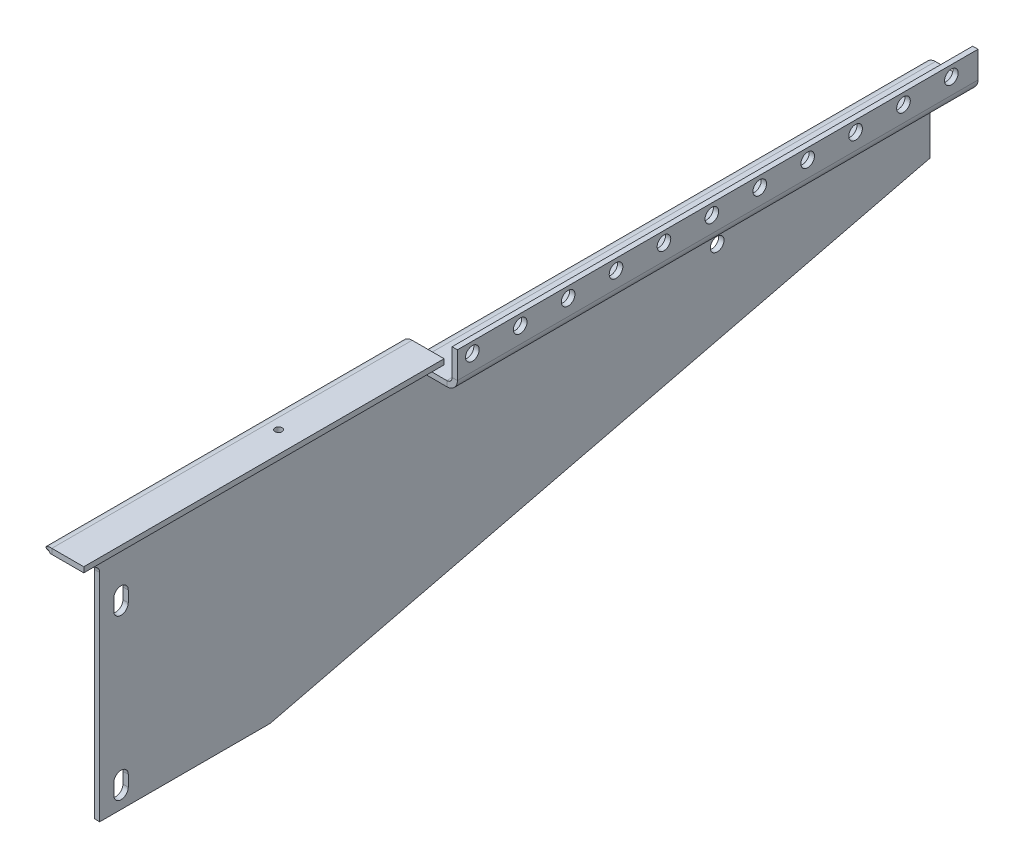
ISO-10303-21;
HEADER;
FILE_DESCRIPTION(('STEP AP214'),'2;1');
FILE_NAME('part.step','',(''),(''),'','','');
FILE_SCHEMA(('AUTOMOTIVE_DESIGN { 1 0 10303 214 1 1 1 1 }'));
ENDSEC;
DATA;
#1=APPLICATION_CONTEXT('core data for automotive mechanical design processes');
#2=APPLICATION_PROTOCOL_DEFINITION('international standard','automotive_design',2000,#1);
#3=PRODUCT_CONTEXT('',#1,'mechanical');
#4=PRODUCT('Part','Part','',(#3));
#5=PRODUCT_RELATED_PRODUCT_CATEGORY('part','',(#4));
#6=PRODUCT_DEFINITION_FORMATION('','',#4);
#7=PRODUCT_DEFINITION_CONTEXT('part definition',#1,'design');
#8=PRODUCT_DEFINITION('design','',#6,#7);
#9=PRODUCT_DEFINITION_SHAPE('','',#8);
#10=(LENGTH_UNIT() NAMED_UNIT(*) SI_UNIT(.MILLI.,.METRE.));
#11=(NAMED_UNIT(*) PLANE_ANGLE_UNIT() SI_UNIT($,.RADIAN.));
#12=(NAMED_UNIT(*) SI_UNIT($,.STERADIAN.) SOLID_ANGLE_UNIT());
#13=UNCERTAINTY_MEASURE_WITH_UNIT(LENGTH_MEASURE(1.E-05),#10,'distance_accuracy_value','');
#14=(GEOMETRIC_REPRESENTATION_CONTEXT(3) GLOBAL_UNCERTAINTY_ASSIGNED_CONTEXT((#13)) GLOBAL_UNIT_ASSIGNED_CONTEXT((#10,
#11,#12)) REPRESENTATION_CONTEXT('',''));
#15=CARTESIAN_POINT('',(0.,0.,0.));
#16=DIRECTION('',(0.,0.,1.));
#17=DIRECTION('',(1.,0.,0.));
#18=AXIS2_PLACEMENT_3D('',#15,#16,#17);
#19=CARTESIAN_POINT('',(0.,0.,415.));
#20=DIRECTION('',(-1.,0.,0.));
#21=DIRECTION('',(0.,0.,1.));
#22=AXIS2_PLACEMENT_3D('',#19,#20,#21);
#23=PLANE('',#22);
#24=CARTESIAN_POINT('',(0.,87.6,380.));
#25=DIRECTION('',(-1.,0.,0.));
#26=DIRECTION('',(0.,0.,1.));
#27=AXIS2_PLACEMENT_3D('',#24,#25,#26);
#28=CIRCLE('',#27,3.40000000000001);
#29=CARTESIAN_POINT('',(0.,87.6,383.4));
#30=VERTEX_POINT('',#29);
#31=CARTESIAN_POINT('',(0.,87.6,376.6));
#32=VERTEX_POINT('',#31);
#33=EDGE_CURVE('E303',#30,#32,#28,.T.);
#34=ORIENTED_EDGE('',*,*,#33,.F.);
#35=DIRECTION('',(0.,1.,0.));
#36=VECTOR('',#35,1.);
#37=CARTESIAN_POINT('',(0.,0.,383.4));
#38=LINE('',#37,#36);
#39=CARTESIAN_POINT('',(0.,82.4,383.4));
#40=VERTEX_POINT('',#39);
#41=EDGE_CURVE('E291',#40,#30,#38,.T.);
#42=ORIENTED_EDGE('',*,*,#41,.F.);
#43=CARTESIAN_POINT('',(0.,82.4,380.));
#44=DIRECTION('',(-1.,0.,0.));
#45=DIRECTION('',(0.,0.,1.));
#46=AXIS2_PLACEMENT_3D('',#43,#44,#45);
#47=CIRCLE('',#46,3.40000000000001);
#48=CARTESIAN_POINT('',(0.,82.4,376.6));
#49=VERTEX_POINT('',#48);
#50=EDGE_CURVE('E264',#49,#40,#47,.T.);
#51=ORIENTED_EDGE('',*,*,#50,.F.);
#52=DIRECTION('',(0.,-1.,0.));
#53=VECTOR('',#52,1.);
#54=CARTESIAN_POINT('',(0.,0.,376.6));
#55=LINE('',#54,#53);
#56=EDGE_CURVE('E300',#32,#49,#55,.T.);
#57=ORIENTED_EDGE('',*,*,#56,.F.);
#58=EDGE_LOOP('',(#34,#42,#51,#57));
#59=FACE_BOUND('',#58,.T.);
#60=CARTESIAN_POINT('',(0.,12.6,380.));
#61=DIRECTION('',(-1.,0.,0.));
#62=DIRECTION('',(0.,0.,1.));
#63=AXIS2_PLACEMENT_3D('',#60,#61,#62);
#64=CIRCLE('',#63,3.40000000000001);
#65=CARTESIAN_POINT('',(0.,12.6,383.4));
#66=VERTEX_POINT('',#65);
#67=CARTESIAN_POINT('',(0.,12.6,376.6));
#68=VERTEX_POINT('',#67);
#69=EDGE_CURVE('E344',#66,#68,#64,.T.);
#70=ORIENTED_EDGE('',*,*,#69,.F.);
#71=DIRECTION('',(0.,1.,0.));
#72=VECTOR('',#71,1.);
#73=CARTESIAN_POINT('',(0.,0.,383.4));
#74=LINE('',#73,#72);
#75=CARTESIAN_POINT('',(0.,7.4,383.4));
#76=VERTEX_POINT('',#75);
#77=EDGE_CURVE('E325',#76,#66,#74,.T.);
#78=ORIENTED_EDGE('',*,*,#77,.F.);
#79=CARTESIAN_POINT('',(0.,7.4,380.));
#80=DIRECTION('',(-1.,0.,0.));
#81=DIRECTION('',(0.,0.,1.));
#82=AXIS2_PLACEMENT_3D('',#79,#80,#81);
#83=CIRCLE('',#82,3.40000000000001);
#84=CARTESIAN_POINT('',(0.,7.4,376.6));
#85=VERTEX_POINT('',#84);
#86=EDGE_CURVE('E337',#85,#76,#83,.T.);
#87=ORIENTED_EDGE('',*,*,#86,.F.);
#88=DIRECTION('',(0.,-1.,0.));
#89=VECTOR('',#88,1.);
#90=CARTESIAN_POINT('',(0.,0.,376.6));
#91=LINE('',#90,#89);
#92=EDGE_CURVE('E341',#68,#85,#91,.T.);
#93=ORIENTED_EDGE('',*,*,#92,.F.);
#94=EDGE_LOOP('',(#70,#78,#87,#93));
#95=FACE_BOUND('',#94,.T.);
#96=DIRECTION('',(0.,-1.,0.));
#97=VECTOR('',#96,1.);
#98=CARTESIAN_POINT('',(0.,125.,245.75));
#99=LINE('',#98,#97);
#100=CARTESIAN_POINT('',(0.,120.,245.75));
#101=VERTEX_POINT('',#100);
#102=CARTESIAN_POINT('',(0.,109.25,245.75));
#103=VERTEX_POINT('',#102);
#104=EDGE_CURVE('E577',#101,#103,#99,.T.);
#105=ORIENTED_EDGE('',*,*,#104,.T.);
#106=DIRECTION('',(0.,0.,-1.));
#107=VECTOR('',#106,1.);
#108=CARTESIAN_POINT('',(0.,109.25,415.));
#109=LINE('',#108,#107);
#110=CARTESIAN_POINT('',(0.,109.25,244.5));
#111=VERTEX_POINT('',#110);
#112=EDGE_CURVE('E567',#103,#111,#109,.T.);
#113=ORIENTED_EDGE('',*,*,#112,.T.);
#114=DIRECTION('',(0.,1.,0.));
#115=VECTOR('',#114,1.);
#116=CARTESIAN_POINT('',(0.,0.,244.5));
#117=LINE('',#116,#115);
#118=CARTESIAN_POINT('',(0.,110.5,244.5));
#119=VERTEX_POINT('',#118);
#120=EDGE_CURVE('E552',#111,#119,#117,.T.);
#121=ORIENTED_EDGE('',*,*,#120,.T.);
#122=DIRECTION('',(0.,0.,1.));
#123=VECTOR('',#122,1.);
#124=CARTESIAN_POINT('',(0.,110.5,244.5));
#125=LINE('',#124,#123);
#126=CARTESIAN_POINT('',(0.,110.5,0.));
#127=VERTEX_POINT('',#126);
#128=EDGE_CURVE('E529',#119,#127,#125,.F.);
#129=ORIENTED_EDGE('',*,*,#128,.T.);
#130=DIRECTION('',(0.,1.,0.));
#131=VECTOR('',#130,1.);
#132=CARTESIAN_POINT('',(0.,0.,0.));
#133=LINE('',#132,#131);
#134=CARTESIAN_POINT('',(0.,75.,0.));
#135=VERTEX_POINT('',#134);
#136=EDGE_CURVE('E657',#135,#127,#133,.T.);
#137=ORIENTED_EDGE('',*,*,#136,.F.);
#138=DIRECTION('',(0.,-0.235151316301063,0.971958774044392));
#139=VECTOR('',#138,1.);
#140=CARTESIAN_POINT('',(0.,-23.9985254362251,409.193905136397));
#141=LINE('',#140,#139);
#142=CARTESIAN_POINT('',(0.,0.,310.));
#143=VERTEX_POINT('',#142);
#144=EDGE_CURVE('E648',#135,#143,#141,.T.);
#145=ORIENTED_EDGE('',*,*,#144,.T.);
#146=DIRECTION('',(0.,0.,-1.));
#147=VECTOR('',#146,1.);
#148=CARTESIAN_POINT('',(0.,0.,415.));
#149=LINE('',#148,#147);
#150=CARTESIAN_POINT('',(0.,0.,390.));
#151=VERTEX_POINT('',#150);
#152=EDGE_CURVE('E690',#151,#143,#149,.T.);
#153=ORIENTED_EDGE('',*,*,#152,.F.);
#154=DIRECTION('',(0.,1.,0.));
#155=VECTOR('',#154,1.);
#156=CARTESIAN_POINT('',(0.,101.407115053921,390.));
#157=LINE('',#156,#155);
#158=CARTESIAN_POINT('',(0.,101.407115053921,390.));
#159=VERTEX_POINT('',#158);
#160=EDGE_CURVE('E608',#151,#159,#157,.T.);
#161=ORIENTED_EDGE('',*,*,#160,.T.);
#162=CARTESIAN_POINT('',(0.,101.407115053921,393.2));
#163=DIRECTION('',(1.,0.,0.));
#164=DIRECTION('',(0.,0.,-1.));
#165=AXIS2_PLACEMENT_3D('',#162,#163,#164);
#166=CIRCLE('',#165,3.20000000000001);
#167=CARTESIAN_POINT('',(0.,103.928749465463,391.229883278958));
#168=VERTEX_POINT('',#167);
#169=EDGE_CURVE('E616',#159,#168,#166,.T.);
#170=ORIENTED_EDGE('',*,*,#169,.T.);
#171=DIRECTION('',(0.,0.615661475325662,0.788010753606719));
#172=VECTOR('',#171,1.);
#173=CARTESIAN_POINT('',(0.,122.5,415.));
#174=LINE('',#173,#172);
#175=CARTESIAN_POINT('',(0.,120.,411.800145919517));
#176=VERTEX_POINT('',#175);
#177=EDGE_CURVE('E612',#168,#176,#174,.T.);
#178=ORIENTED_EDGE('',*,*,#177,.T.);
#179=DIRECTION('',(0.,0.,-1.));
#180=VECTOR('',#179,1.);
#181=CARTESIAN_POINT('',(0.,120.,415.));
#182=LINE('',#181,#180);
#183=EDGE_CURVE('E693',#176,#101,#182,.T.);
#184=ORIENTED_EDGE('',*,*,#183,.T.);
#185=EDGE_LOOP('',(#105,#113,#121,#129,#137,#145,#153,#161,#170,#178,#184));
#186=FACE_BOUND('',#185,.T.);
#187=CARTESIAN_POINT('',(0.,90.,100.));
#188=DIRECTION('',(1.,0.,0.));
#189=DIRECTION('',(0.,0.,-1.));
#190=AXIS2_PLACEMENT_3D('',#187,#188,#189);
#191=CIRCLE('',#190,3.19999999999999);
#192=CARTESIAN_POINT('',(0.,90.,96.8));
#193=VERTEX_POINT('',#192);
#194=EDGE_CURVE('E347',#193,#193,#191,.T.);
#195=ORIENTED_EDGE('',*,*,#194,.T.);
#196=EDGE_LOOP('',(#195));
#197=FACE_BOUND('',#196,.T.);
#198=ADVANCED_FACE('F52',(#59,#95,#186,#197),#23,.T.);
#199=CARTESIAN_POINT('',(22.5,115.5,244.5));
#200=DIRECTION('',(0.,0.,-1.));
#201=DIRECTION('',(-1.,0.,0.));
#202=AXIS2_PLACEMENT_3D('',#199,#200,#201);
#203=PLANE('',#202);
#204=DIRECTION('',(0.,-1.,0.));
#205=VECTOR('',#204,1.);
#206=CARTESIAN_POINT('',(20.,115.5,244.5));
#207=LINE('',#206,#205);
#208=CARTESIAN_POINT('',(20.,115.5,244.5));
#209=VERTEX_POINT('',#208);
#210=CARTESIAN_POINT('',(20.,113.,244.5));
#211=VERTEX_POINT('',#210);
#212=EDGE_CURVE('E482',#209,#211,#207,.T.);
#213=ORIENTED_EDGE('',*,*,#212,.F.);
#214=DIRECTION('',(1.,0.,0.));
#215=VECTOR('',#214,1.);
#216=CARTESIAN_POINT('',(22.5,115.5,244.5));
#217=LINE('',#216,#215);
#218=CARTESIAN_POINT('',(4.99999999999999,115.5,244.5));
#219=VERTEX_POINT('',#218);
#220=EDGE_CURVE('E510',#219,#209,#217,.T.);
#221=ORIENTED_EDGE('',*,*,#220,.F.);
#222=DIRECTION('',(0.,1.,0.));
#223=VECTOR('',#222,1.);
#224=CARTESIAN_POINT('',(4.99999999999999,113.,244.5));
#225=LINE('',#224,#223);
#226=CARTESIAN_POINT('',(4.99999999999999,113.,244.5));
#227=VERTEX_POINT('',#226);
#228=EDGE_CURVE('E492',#227,#219,#225,.T.);
#229=ORIENTED_EDGE('',*,*,#228,.F.);
#230=DIRECTION('',(1.,0.,0.));
#231=VECTOR('',#230,1.);
#232=CARTESIAN_POINT('',(22.5,113.,244.5));
#233=LINE('',#232,#231);
#234=EDGE_CURVE('E503',#227,#211,#233,.T.);
#235=ORIENTED_EDGE('',*,*,#234,.T.);
#236=EDGE_LOOP('',(#213,#221,#229,#235));
#237=FACE_BOUND('',#236,.T.);
#238=ADVANCED_FACE('F802',(#237),#203,.F.);
#239=CARTESIAN_POINT('',(2.49999999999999,115.5,0.));
#240=DIRECTION('',(0.,0.,1.));
#241=DIRECTION('',(1.,0.,0.));
#242=AXIS2_PLACEMENT_3D('',#239,#240,#241);
#243=PLANE('',#242);
#244=DIRECTION('',(0.,-1.,0.));
#245=VECTOR('',#244,1.);
#246=CARTESIAN_POINT('',(20.,115.5,0.));
#247=LINE('',#246,#245);
#248=CARTESIAN_POINT('',(20.,115.5,0.));
#249=VERTEX_POINT('',#248);
#250=CARTESIAN_POINT('',(20.,113.,0.));
#251=VERTEX_POINT('',#250);
#252=EDGE_CURVE('E478',#249,#251,#247,.T.);
#253=ORIENTED_EDGE('',*,*,#252,.T.);
#254=DIRECTION('',(-1.,0.,0.));
#255=VECTOR('',#254,1.);
#256=CARTESIAN_POINT('',(2.5,113.,0.));
#257=LINE('',#256,#255);
#258=CARTESIAN_POINT('',(4.99999999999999,113.,0.));
#259=VERTEX_POINT('',#258);
#260=EDGE_CURVE('E507',#251,#259,#257,.T.);
#261=ORIENTED_EDGE('',*,*,#260,.T.);
#262=DIRECTION('',(0.,1.,0.));
#263=VECTOR('',#262,1.);
#264=CARTESIAN_POINT('',(4.99999999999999,113.,0.));
#265=LINE('',#264,#263);
#266=CARTESIAN_POINT('',(4.99999999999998,115.5,0.));
#267=VERTEX_POINT('',#266);
#268=EDGE_CURVE('E486',#259,#267,#265,.T.);
#269=ORIENTED_EDGE('',*,*,#268,.T.);
#270=DIRECTION('',(-1.,0.,0.));
#271=VECTOR('',#270,1.);
#272=CARTESIAN_POINT('',(2.49999999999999,115.5,0.));
#273=LINE('',#272,#271);
#274=EDGE_CURVE('E514',#249,#267,#273,.T.);
#275=ORIENTED_EDGE('',*,*,#274,.F.);
#276=EDGE_LOOP('',(#253,#261,#269,#275));
#277=FACE_BOUND('',#276,.T.);
#278=ADVANCED_FACE('F808',(#277),#243,.F.);
#279=CARTESIAN_POINT('',(22.5,115.5,244.5));
#280=DIRECTION('',(0.,1.,0.));
#281=DIRECTION('',(-1.,0.,0.));
#282=AXIS2_PLACEMENT_3D('',#279,#280,#281);
#283=PLANE('',#282);
#284=ORIENTED_EDGE('',*,*,#220,.T.);
#285=DIRECTION('',(0.,0.,-1.));
#286=VECTOR('',#285,1.);
#287=CARTESIAN_POINT('',(20.,115.5,0.));
#288=LINE('',#287,#286);
#289=EDGE_CURVE('E465',#249,#209,#288,.F.);
#290=ORIENTED_EDGE('',*,*,#289,.F.);
#291=ORIENTED_EDGE('',*,*,#274,.T.);
#292=DIRECTION('',(0.,0.,1.));
#293=VECTOR('',#292,1.);
#294=CARTESIAN_POINT('',(4.99999999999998,115.5,244.5));
#295=LINE('',#294,#293);
#296=EDGE_CURVE('E496',#267,#219,#295,.T.);
#297=ORIENTED_EDGE('',*,*,#296,.T.);
#298=EDGE_LOOP('',(#284,#290,#291,#297));
#299=FACE_BOUND('',#298,.T.);
#300=ADVANCED_FACE('F871',(#299),#283,.T.);
#301=CARTESIAN_POINT('',(22.5,113.,244.5));
#302=DIRECTION('',(0.,1.,0.));
#303=DIRECTION('',(-1.,0.,0.));
#304=AXIS2_PLACEMENT_3D('',#301,#302,#303);
#305=PLANE('',#304);
#306=DIRECTION('',(0.,0.,-1.));
#307=VECTOR('',#306,1.);
#308=CARTESIAN_POINT('',(20.,113.,0.));
#309=LINE('',#308,#307);
#310=EDGE_CURVE('E472',#251,#211,#309,.F.);
#311=ORIENTED_EDGE('',*,*,#310,.T.);
#312=ORIENTED_EDGE('',*,*,#234,.F.);
#313=DIRECTION('',(0.,0.,1.));
#314=VECTOR('',#313,1.);
#315=CARTESIAN_POINT('',(4.99999999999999,113.,0.));
#316=LINE('',#315,#314);
#317=EDGE_CURVE('E489',#259,#227,#316,.T.);
#318=ORIENTED_EDGE('',*,*,#317,.F.);
#319=ORIENTED_EDGE('',*,*,#260,.F.);
#320=EDGE_LOOP('',(#311,#312,#318,#319));
#321=FACE_BOUND('',#320,.T.);
#322=ADVANCED_FACE('F875',(#321),#305,.F.);
#323=CARTESIAN_POINT('',(2.5,0.,415.));
#324=DIRECTION('',(-1.,0.,0.));
#325=DIRECTION('',(0.,0.,1.));
#326=AXIS2_PLACEMENT_3D('',#323,#324,#325);
#327=PLANE('',#326);
#328=DIRECTION('',(0.,-1.,0.));
#329=VECTOR('',#328,1.);
#330=CARTESIAN_POINT('',(2.5,87.6,383.4));
#331=LINE('',#330,#329);
#332=CARTESIAN_POINT('',(2.5,87.6,383.4));
#333=VERTEX_POINT('',#332);
#334=CARTESIAN_POINT('',(2.5,82.4,383.4));
#335=VERTEX_POINT('',#334);
#336=EDGE_CURVE('E271',#333,#335,#331,.T.);
#337=ORIENTED_EDGE('',*,*,#336,.F.);
#338=CARTESIAN_POINT('',(2.5,87.6,380.));
#339=DIRECTION('',(1.,0.,0.));
#340=DIRECTION('',(0.,0.,1.));
#341=AXIS2_PLACEMENT_3D('',#338,#339,#340);
#342=CIRCLE('',#341,3.40000000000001);
#343=CARTESIAN_POINT('',(2.5,87.6,376.6));
#344=VERTEX_POINT('',#343);
#345=EDGE_CURVE('E78',#344,#333,#342,.T.);
#346=ORIENTED_EDGE('',*,*,#345,.F.);
#347=DIRECTION('',(0.,1.,0.));
#348=VECTOR('',#347,1.);
#349=CARTESIAN_POINT('',(2.5,87.6,376.6));
#350=LINE('',#349,#348);
#351=CARTESIAN_POINT('',(2.5,82.4,376.6));
#352=VERTEX_POINT('',#351);
#353=EDGE_CURVE('E279',#352,#344,#350,.T.);
#354=ORIENTED_EDGE('',*,*,#353,.F.);
#355=CARTESIAN_POINT('',(2.5,82.4,380.));
#356=DIRECTION('',(1.,0.,0.));
#357=DIRECTION('',(0.,0.,-1.));
#358=AXIS2_PLACEMENT_3D('',#355,#356,#357);
#359=CIRCLE('',#358,3.40000000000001);
#360=EDGE_CURVE('E261',#335,#352,#359,.T.);
#361=ORIENTED_EDGE('',*,*,#360,.F.);
#362=EDGE_LOOP('',(#337,#346,#354,#361));
#363=FACE_BOUND('',#362,.T.);
#364=DIRECTION('',(0.,-1.,0.));
#365=VECTOR('',#364,1.);
#366=CARTESIAN_POINT('',(2.5,12.6,383.4));
#367=LINE('',#366,#365);
#368=CARTESIAN_POINT('',(2.5,12.6,383.4));
#369=VERTEX_POINT('',#368);
#370=CARTESIAN_POINT('',(2.5,7.4,383.4));
#371=VERTEX_POINT('',#370);
#372=EDGE_CURVE('E309',#369,#371,#367,.T.);
#373=ORIENTED_EDGE('',*,*,#372,.F.);
#374=CARTESIAN_POINT('',(2.5,12.6,380.));
#375=DIRECTION('',(1.,0.,0.));
#376=DIRECTION('',(0.,0.,1.));
#377=AXIS2_PLACEMENT_3D('',#374,#375,#376);
#378=CIRCLE('',#377,3.40000000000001);
#379=CARTESIAN_POINT('',(2.5,12.6,376.6));
#380=VERTEX_POINT('',#379);
#381=EDGE_CURVE('E306',#380,#369,#378,.T.);
#382=ORIENTED_EDGE('',*,*,#381,.F.);
#383=DIRECTION('',(0.,1.,0.));
#384=VECTOR('',#383,1.);
#385=CARTESIAN_POINT('',(2.5,12.6,376.6));
#386=LINE('',#385,#384);
#387=CARTESIAN_POINT('',(2.5,7.4,376.6));
#388=VERTEX_POINT('',#387);
#389=EDGE_CURVE('E317',#388,#380,#386,.T.);
#390=ORIENTED_EDGE('',*,*,#389,.F.);
#391=CARTESIAN_POINT('',(2.5,7.4,380.));
#392=DIRECTION('',(1.,0.,0.));
#393=DIRECTION('',(0.,0.,-1.));
#394=AXIS2_PLACEMENT_3D('',#391,#392,#393);
#395=CIRCLE('',#394,3.40000000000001);
#396=EDGE_CURVE('E313',#371,#388,#395,.T.);
#397=ORIENTED_EDGE('',*,*,#396,.F.);
#398=EDGE_LOOP('',(#373,#382,#390,#397));
#399=FACE_BOUND('',#398,.T.);
#400=CARTESIAN_POINT('',(2.5,90.,100.));
#401=DIRECTION('',(1.,0.,0.));
#402=DIRECTION('',(0.,0.,-1.));
#403=AXIS2_PLACEMENT_3D('',#400,#401,#402);
#404=CIRCLE('',#403,3.19999999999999);
#405=CARTESIAN_POINT('',(2.5,90.,96.8));
#406=VERTEX_POINT('',#405);
#407=EDGE_CURVE('E351',#406,#406,#404,.T.);
#408=ORIENTED_EDGE('',*,*,#407,.F.);
#409=EDGE_LOOP('',(#408));
#410=FACE_BOUND('',#409,.T.);
#411=DIRECTION('',(0.,0.,-1.));
#412=VECTOR('',#411,1.);
#413=CARTESIAN_POINT('',(2.5,109.25,245.75));
#414=LINE('',#413,#412);
#415=CARTESIAN_POINT('',(2.5,109.25,245.75));
#416=VERTEX_POINT('',#415);
#417=CARTESIAN_POINT('',(2.5,109.25,244.5));
#418=VERTEX_POINT('',#417);
#419=EDGE_CURVE('E548',#416,#418,#414,.T.);
#420=ORIENTED_EDGE('',*,*,#419,.F.);
#421=DIRECTION('',(0.,1.,0.));
#422=VECTOR('',#421,1.);
#423=CARTESIAN_POINT('',(2.5,0.,245.75));
#424=LINE('',#423,#422);
#425=CARTESIAN_POINT('',(2.5,120.,245.75));
#426=VERTEX_POINT('',#425);
#427=EDGE_CURVE('E580',#426,#416,#424,.F.);
#428=ORIENTED_EDGE('',*,*,#427,.F.);
#429=DIRECTION('',(0.,0.,-1.));
#430=VECTOR('',#429,1.);
#431=CARTESIAN_POINT('',(2.5,120.,415.));
#432=LINE('',#431,#430);
#433=CARTESIAN_POINT('',(2.5,120.,411.800145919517));
#434=VERTEX_POINT('',#433);
#435=EDGE_CURVE('E683',#434,#426,#432,.T.);
#436=ORIENTED_EDGE('',*,*,#435,.F.);
#437=DIRECTION('',(0.,0.615661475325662,0.788010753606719));
#438=VECTOR('',#437,1.);
#439=CARTESIAN_POINT('',(2.5,122.5,415.));
#440=LINE('',#439,#438);
#441=CARTESIAN_POINT('',(2.5,103.928749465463,391.229883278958));
#442=VERTEX_POINT('',#441);
#443=EDGE_CURVE('E623',#442,#434,#440,.T.);
#444=ORIENTED_EDGE('',*,*,#443,.F.);
#445=CARTESIAN_POINT('',(2.5,101.407115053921,393.2));
#446=DIRECTION('',(1.,0.,0.));
#447=DIRECTION('',(0.,0.,-1.));
#448=AXIS2_PLACEMENT_3D('',#445,#446,#447);
#449=CIRCLE('',#448,3.20000000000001);
#450=CARTESIAN_POINT('',(2.5,101.407115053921,390.));
#451=VERTEX_POINT('',#450);
#452=EDGE_CURVE('E624',#451,#442,#449,.T.);
#453=ORIENTED_EDGE('',*,*,#452,.F.);
#454=DIRECTION('',(0.,1.,0.));
#455=VECTOR('',#454,1.);
#456=CARTESIAN_POINT('',(2.5,0.,390.));
#457=LINE('',#456,#455);
#458=CARTESIAN_POINT('',(2.5,0.,390.));
#459=VERTEX_POINT('',#458);
#460=EDGE_CURVE('E620',#459,#451,#457,.T.);
#461=ORIENTED_EDGE('',*,*,#460,.F.);
#462=DIRECTION('',(0.,0.,-1.));
#463=VECTOR('',#462,1.);
#464=CARTESIAN_POINT('',(2.5,0.,415.));
#465=LINE('',#464,#463);
#466=CARTESIAN_POINT('',(2.5,0.,310.));
#467=VERTEX_POINT('',#466);
#468=EDGE_CURVE('E687',#459,#467,#465,.T.);
#469=ORIENTED_EDGE('',*,*,#468,.T.);
#470=DIRECTION('',(0.,-0.235151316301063,0.971958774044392));
#471=VECTOR('',#470,1.);
#472=CARTESIAN_POINT('',(2.5,-23.9985254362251,409.193905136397));
#473=LINE('',#472,#471);
#474=CARTESIAN_POINT('',(2.5,75.,0.));
#475=VERTEX_POINT('',#474);
#476=EDGE_CURVE('E642',#475,#467,#473,.T.);
#477=ORIENTED_EDGE('',*,*,#476,.F.);
#478=DIRECTION('',(0.,1.,0.));
#479=VECTOR('',#478,1.);
#480=CARTESIAN_POINT('',(2.5,0.,0.));
#481=LINE('',#480,#479);
#482=CARTESIAN_POINT('',(2.5,110.5,0.));
#483=VERTEX_POINT('',#482);
#484=EDGE_CURVE('E664',#475,#483,#481,.T.);
#485=ORIENTED_EDGE('',*,*,#484,.T.);
#486=DIRECTION('',(0.,0.,1.));
#487=VECTOR('',#486,1.);
#488=CARTESIAN_POINT('',(2.5,110.5,244.5));
#489=LINE('',#488,#487);
#490=CARTESIAN_POINT('',(2.5,110.5,244.5));
#491=VERTEX_POINT('',#490);
#492=EDGE_CURVE('E523',#491,#483,#489,.F.);
#493=ORIENTED_EDGE('',*,*,#492,.F.);
#494=DIRECTION('',(0.,1.,0.));
#495=VECTOR('',#494,1.);
#496=CARTESIAN_POINT('',(2.5,109.25,244.5));
#497=LINE('',#496,#495);
#498=EDGE_CURVE('E554',#418,#491,#497,.T.);
#499=ORIENTED_EDGE('',*,*,#498,.F.);
#500=EDGE_LOOP('',(#420,#428,#436,#444,#453,#461,#469,#477,#485,#493,#499));
#501=FACE_BOUND('',#500,.T.);
#502=ADVANCED_FACE('F276',(#363,#399,#410,#501),#327,.F.);
#503=CARTESIAN_POINT('',(5.,120.,415.));
#504=DIRECTION('',(0.,0.,-1.));
#505=DIRECTION('',(-1.,0.,0.));
#506=AXIS2_PLACEMENT_3D('',#503,#504,#505);
#507=CYLINDRICAL_SURFACE('',#506,5.);
#508=DIRECTION('',(0.,0.,-1.));
#509=VECTOR('',#508,1.);
#510=CARTESIAN_POINT('',(5.,125.,415.));
#511=LINE('',#510,#509);
#512=CARTESIAN_POINT('',(5.,125.,415.));
#513=VERTEX_POINT('',#512);
#514=CARTESIAN_POINT('',(5.,125.,245.75));
#515=VERTEX_POINT('',#514);
#516=EDGE_CURVE('E697',#513,#515,#511,.T.);
#517=ORIENTED_EDGE('',*,*,#516,.T.);
#518=CARTESIAN_POINT('',(5.,120.,245.75));
#519=DIRECTION('',(0.,0.,-1.));
#520=DIRECTION('',(-1.,0.,0.));
#521=AXIS2_PLACEMENT_3D('',#518,#519,#520);
#522=CIRCLE('',#521,5.);
#523=EDGE_CURVE('E570',#515,#101,#522,.F.);
#524=ORIENTED_EDGE('',*,*,#523,.T.);
#525=ORIENTED_EDGE('',*,*,#183,.F.);
#526=CARTESIAN_POINT('',(5.,120.,411.800145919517));
#527=DIRECTION('',(0.,-0.539036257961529,0.842282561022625));
#528=DIRECTION('',(0.,-0.842282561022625,-0.539036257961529));
#529=AXIS2_PLACEMENT_3D('',#526,#527,#528);
#530=ELLIPSE('',#529,5.93625017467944,5.);
#531=EDGE_CURVE('E604',#176,#513,#530,.F.);
#532=ORIENTED_EDGE('',*,*,#531,.T.);
#533=EDGE_LOOP('',(#517,#524,#525,#532));
#534=FACE_BOUND('',#533,.T.);
#535=ADVANCED_FACE('F817',(#534),#507,.T.);
#536=CARTESIAN_POINT('',(5.,120.,415.));
#537=DIRECTION('',(0.,0.,-1.));
#538=DIRECTION('',(-1.,0.,0.));
#539=AXIS2_PLACEMENT_3D('',#536,#537,#538);
#540=CYLINDRICAL_SURFACE('',#539,2.5);
#541=CARTESIAN_POINT('',(5.,120.,245.75));
#542=DIRECTION('',(0.,0.,-1.));
#543=DIRECTION('',(-1.,0.,0.));
#544=AXIS2_PLACEMENT_3D('',#541,#542,#543);
#545=CIRCLE('',#544,2.5);
#546=CARTESIAN_POINT('',(5.,122.5,245.75));
#547=VERTEX_POINT('',#546);
#548=EDGE_CURVE('E574',#547,#426,#545,.F.);
#549=ORIENTED_EDGE('',*,*,#548,.F.);
#550=DIRECTION('',(0.,0.,-1.));
#551=VECTOR('',#550,1.);
#552=CARTESIAN_POINT('',(5.,122.5,415.));
#553=LINE('',#552,#551);
#554=CARTESIAN_POINT('',(5.,122.5,415.));
#555=VERTEX_POINT('',#554);
#556=EDGE_CURVE('E679',#555,#547,#553,.T.);
#557=ORIENTED_EDGE('',*,*,#556,.F.);
#558=CARTESIAN_POINT('',(5.,120.,411.800145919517));
#559=DIRECTION('',(0.,-0.788010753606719,0.615661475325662));
#560=DIRECTION('',(0.,-0.615661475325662,-0.788010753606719));
#561=AXIS2_PLACEMENT_3D('',#558,#559,#560);
#562=ELLIPSE('',#561,4.06067311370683,2.5);
#563=EDGE_CURVE('E599',#434,#555,#562,.F.);
#564=ORIENTED_EDGE('',*,*,#563,.F.);
#565=ORIENTED_EDGE('',*,*,#435,.T.);
#566=EDGE_LOOP('',(#549,#557,#564,#565));
#567=FACE_BOUND('',#566,.T.);
#568=ADVANCED_FACE('F820',(#567),#540,.F.);
#569=CARTESIAN_POINT('',(5.,122.5,0.));
#570=DIRECTION('',(0.,0.,-1.));
#571=DIRECTION('',(-1.,0.,0.));
#572=AXIS2_PLACEMENT_3D('',#569,#570,#571);
#573=PLANE('',#572);
#574=DIRECTION('',(-1.,0.,0.));
#575=VECTOR('',#574,1.);
#576=CARTESIAN_POINT('',(2.5,110.5,0.));
#577=LINE('',#576,#575);
#578=EDGE_CURVE('E541',#483,#127,#577,.T.);
#579=ORIENTED_EDGE('',*,*,#578,.F.);
#580=ORIENTED_EDGE('',*,*,#484,.F.);
#581=DIRECTION('',(1.,0.,0.));
#582=VECTOR('',#581,1.);
#583=CARTESIAN_POINT('',(2.5,75.,0.));
#584=LINE('',#583,#582);
#585=EDGE_CURVE('E652',#475,#135,#584,.F.);
#586=ORIENTED_EDGE('',*,*,#585,.T.);
#587=ORIENTED_EDGE('',*,*,#136,.T.);
#588=EDGE_LOOP('',(#579,#580,#586,#587));
#589=FACE_BOUND('',#588,.T.);
#590=ADVANCED_FACE('F832',(#589),#573,.T.);
#591=CARTESIAN_POINT('',(0.,122.5,415.));
#592=DIRECTION('',(0.,1.,0.));
#593=DIRECTION('',(0.,0.,1.));
#594=AXIS2_PLACEMENT_3D('',#591,#592,#593);
#595=PLANE('',#594);
#596=CARTESIAN_POINT('',(10.,122.5,313.5));
#597=DIRECTION('',(0.,1.,0.));
#598=DIRECTION('',(0.,0.,1.));
#599=AXIS2_PLACEMENT_3D('',#596,#597,#598);
#600=CIRCLE('',#599,1.65);
#601=CARTESIAN_POINT('',(10.,122.5,315.15));
#602=VERTEX_POINT('',#601);
#603=EDGE_CURVE('E413',#602,#602,#600,.T.);
#604=ORIENTED_EDGE('',*,*,#603,.T.);
#605=EDGE_LOOP('',(#604));
#606=FACE_BOUND('',#605,.T.);
#607=DIRECTION('',(1.,0.,0.));
#608=VECTOR('',#607,1.);
#609=CARTESIAN_POINT('',(0.,122.5,245.75));
#610=LINE('',#609,#608);
#611=CARTESIAN_POINT('',(20.,122.5,245.75));
#612=VERTEX_POINT('',#611);
#613=EDGE_CURVE('E591',#612,#547,#610,.F.);
#614=ORIENTED_EDGE('',*,*,#613,.F.);
#615=DIRECTION('',(0.,0.,-1.));
#616=VECTOR('',#615,1.);
#617=CARTESIAN_POINT('',(20.,122.5,415.));
#618=LINE('',#617,#616);
#619=CARTESIAN_POINT('',(20.,122.5,415.));
#620=VERTEX_POINT('',#619);
#621=EDGE_CURVE('E62',#620,#612,#618,.T.);
#622=ORIENTED_EDGE('',*,*,#621,.F.);
#623=DIRECTION('',(1.,0.,0.));
#624=VECTOR('',#623,1.);
#625=CARTESIAN_POINT('',(0.,122.5,415.));
#626=LINE('',#625,#624);
#627=EDGE_CURVE('E668',#555,#620,#626,.T.);
#628=ORIENTED_EDGE('',*,*,#627,.F.);
#629=ORIENTED_EDGE('',*,*,#556,.T.);
#630=EDGE_LOOP('',(#614,#622,#628,#629));
#631=FACE_BOUND('',#630,.T.);
#632=ADVANCED_FACE('F829',(#606,#631),#595,.F.);
#633=CARTESIAN_POINT('',(20.,125.,415.));
#634=DIRECTION('',(1.,0.,0.));
#635=DIRECTION('',(0.,0.,-1.));
#636=AXIS2_PLACEMENT_3D('',#633,#634,#635);
#637=PLANE('',#636);
#638=ORIENTED_EDGE('',*,*,#621,.T.);
#639=DIRECTION('',(0.,1.,0.));
#640=VECTOR('',#639,1.);
#641=CARTESIAN_POINT('',(20.,125.,245.75));
#642=LINE('',#641,#640);
#643=CARTESIAN_POINT('',(20.,125.,245.75));
#644=VERTEX_POINT('',#643);
#645=EDGE_CURVE('E594',#644,#612,#642,.F.);
#646=ORIENTED_EDGE('',*,*,#645,.F.);
#647=DIRECTION('',(0.,0.,-1.));
#648=VECTOR('',#647,1.);
#649=CARTESIAN_POINT('',(20.,125.,415.));
#650=LINE('',#649,#648);
#651=CARTESIAN_POINT('',(20.,125.,415.));
#652=VERTEX_POINT('',#651);
#653=EDGE_CURVE('E701',#652,#644,#650,.T.);
#654=ORIENTED_EDGE('',*,*,#653,.F.);
#655=DIRECTION('',(0.,-1.,0.));
#656=VECTOR('',#655,1.);
#657=CARTESIAN_POINT('',(20.,125.,415.));
#658=LINE('',#657,#656);
#659=EDGE_CURVE('E671',#652,#620,#658,.T.);
#660=ORIENTED_EDGE('',*,*,#659,.T.);
#661=EDGE_LOOP('',(#638,#646,#654,#660));
#662=FACE_BOUND('',#661,.T.);
#663=ADVANCED_FACE('F825',(#662),#637,.T.);
#664=CARTESIAN_POINT('',(0.,125.,415.));
#665=DIRECTION('',(0.,1.,0.));
#666=DIRECTION('',(0.,0.,1.));
#667=AXIS2_PLACEMENT_3D('',#664,#665,#666);
#668=PLANE('',#667);
#669=CARTESIAN_POINT('',(10.,125.,313.5));
#670=DIRECTION('',(0.,1.,0.));
#671=DIRECTION('',(0.,0.,1.));
#672=AXIS2_PLACEMENT_3D('',#669,#670,#671);
#673=CIRCLE('',#672,1.65);
#674=CARTESIAN_POINT('',(10.,125.,315.15));
#675=VERTEX_POINT('',#674);
#676=EDGE_CURVE('E409',#675,#675,#673,.T.);
#677=ORIENTED_EDGE('',*,*,#676,.F.);
#678=EDGE_LOOP('',(#677));
#679=FACE_BOUND('',#678,.T.);
#680=ORIENTED_EDGE('',*,*,#653,.T.);
#681=DIRECTION('',(-1.,0.,0.));
#682=VECTOR('',#681,1.);
#683=CARTESIAN_POINT('',(20.,125.,245.75));
#684=LINE('',#683,#682);
#685=EDGE_CURVE('E587',#644,#515,#684,.T.);
#686=ORIENTED_EDGE('',*,*,#685,.T.);
#687=ORIENTED_EDGE('',*,*,#516,.F.);
#688=DIRECTION('',(1.,0.,0.));
#689=VECTOR('',#688,1.);
#690=CARTESIAN_POINT('',(0.,125.,415.));
#691=LINE('',#690,#689);
#692=EDGE_CURVE('E675',#513,#652,#691,.T.);
#693=ORIENTED_EDGE('',*,*,#692,.T.);
#694=EDGE_LOOP('',(#680,#686,#687,#693));
#695=FACE_BOUND('',#694,.T.);
#696=ADVANCED_FACE('F822',(#679,#695),#668,.T.);
#697=CARTESIAN_POINT('',(2.5,0.,415.));
#698=DIRECTION('',(0.,-1.,0.));
#699=DIRECTION('',(0.,0.,-1.));
#700=AXIS2_PLACEMENT_3D('',#697,#698,#699);
#701=PLANE('',#700);
#702=ORIENTED_EDGE('',*,*,#468,.F.);
#703=DIRECTION('',(-1.,0.,0.));
#704=VECTOR('',#703,1.);
#705=CARTESIAN_POINT('',(0.,0.,390.));
#706=LINE('',#705,#704);
#707=EDGE_CURVE('E627',#151,#459,#706,.F.);
#708=ORIENTED_EDGE('',*,*,#707,.F.);
#709=ORIENTED_EDGE('',*,*,#152,.T.);
#710=DIRECTION('',(1.,0.,0.));
#711=VECTOR('',#710,1.);
#712=CARTESIAN_POINT('',(2.5,0.,310.));
#713=LINE('',#712,#711);
#714=EDGE_CURVE('E653',#467,#143,#713,.F.);
#715=ORIENTED_EDGE('',*,*,#714,.F.);
#716=EDGE_LOOP('',(#702,#708,#709,#715));
#717=FACE_BOUND('',#716,.T.);
#718=ADVANCED_FACE('F815',(#717),#701,.T.);
#719=CARTESIAN_POINT('',(2.5,120.,415.));
#720=DIRECTION('',(0.,0.,1.));
#721=DIRECTION('',(1.,0.,0.));
#722=AXIS2_PLACEMENT_3D('',#719,#720,#721);
#723=PLANE('',#722);
#724=ORIENTED_EDGE('',*,*,#692,.F.);
#725=DIRECTION('',(0.,-1.,0.));
#726=VECTOR('',#725,1.);
#727=CARTESIAN_POINT('',(5.,125.,415.));
#728=LINE('',#727,#726);
#729=EDGE_CURVE('E11',#513,#555,#728,.T.);
#730=ORIENTED_EDGE('',*,*,#729,.T.);
#731=ORIENTED_EDGE('',*,*,#627,.T.);
#732=ORIENTED_EDGE('',*,*,#659,.F.);
#733=EDGE_LOOP('',(#724,#730,#731,#732));
#734=FACE_BOUND('',#733,.T.);
#735=ADVANCED_FACE('F54',(#734),#723,.T.);
#736=CARTESIAN_POINT('',(2.5,-23.9985254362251,409.193905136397));
#737=DIRECTION('',(0.,-0.971958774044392,-0.235151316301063));
#738=DIRECTION('',(0.,-0.235151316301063,0.971958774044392));
#739=AXIS2_PLACEMENT_3D('',#736,#737,#738);
#740=PLANE('',#739);
#741=ORIENTED_EDGE('',*,*,#476,.T.);
#742=ORIENTED_EDGE('',*,*,#714,.T.);
#743=ORIENTED_EDGE('',*,*,#144,.F.);
#744=ORIENTED_EDGE('',*,*,#585,.F.);
#745=EDGE_LOOP('',(#741,#742,#743,#744));
#746=FACE_BOUND('',#745,.T.);
#747=ADVANCED_FACE('F854',(#746),#740,.T.);
#748=CARTESIAN_POINT('',(0.,122.5,415.));
#749=DIRECTION('',(0.,-0.788010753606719,0.615661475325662));
#750=DIRECTION('',(0.,0.615661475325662,0.788010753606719));
#751=AXIS2_PLACEMENT_3D('',#748,#749,#750);
#752=PLANE('',#751);
#753=DIRECTION('',(-1.,0.,0.));
#754=VECTOR('',#753,1.);
#755=CARTESIAN_POINT('',(0.,120.,411.800145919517));
#756=LINE('',#755,#754);
#757=EDGE_CURVE('E639',#176,#434,#756,.F.);
#758=ORIENTED_EDGE('',*,*,#757,.F.);
#759=ORIENTED_EDGE('',*,*,#177,.F.);
#760=DIRECTION('',(-1.,0.,0.));
#761=VECTOR('',#760,1.);
#762=CARTESIAN_POINT('',(0.,103.928749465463,391.229883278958));
#763=LINE('',#762,#761);
#764=EDGE_CURVE('E635',#168,#442,#763,.F.);
#765=ORIENTED_EDGE('',*,*,#764,.T.);
#766=ORIENTED_EDGE('',*,*,#443,.T.);
#767=EDGE_LOOP('',(#758,#759,#765,#766));
#768=FACE_BOUND('',#767,.T.);
#769=ADVANCED_FACE('F938',(#768),#752,.T.);
#770=CARTESIAN_POINT('',(0.,101.407115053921,393.2));
#771=DIRECTION('',(1.,0.,0.));
#772=DIRECTION('',(0.,0.,-1.));
#773=AXIS2_PLACEMENT_3D('',#770,#771,#772);
#774=CYLINDRICAL_SURFACE('',#773,3.20000000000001);
#775=ORIENTED_EDGE('',*,*,#764,.F.);
#776=ORIENTED_EDGE('',*,*,#169,.F.);
#777=DIRECTION('',(-1.,0.,0.));
#778=VECTOR('',#777,1.);
#779=CARTESIAN_POINT('',(0.,101.407115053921,390.));
#780=LINE('',#779,#778);
#781=EDGE_CURVE('E631',#159,#451,#780,.F.);
#782=ORIENTED_EDGE('',*,*,#781,.T.);
#783=ORIENTED_EDGE('',*,*,#452,.T.);
#784=EDGE_LOOP('',(#775,#776,#782,#783));
#785=FACE_BOUND('',#784,.T.);
#786=ADVANCED_FACE('F934',(#785),#774,.F.);
#787=CARTESIAN_POINT('',(0.,101.407115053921,390.));
#788=DIRECTION('',(0.,0.,1.));
#789=DIRECTION('',(0.,1.,0.));
#790=AXIS2_PLACEMENT_3D('',#787,#788,#789);
#791=PLANE('',#790);
#792=ORIENTED_EDGE('',*,*,#781,.F.);
#793=ORIENTED_EDGE('',*,*,#160,.F.);
#794=ORIENTED_EDGE('',*,*,#707,.T.);
#795=ORIENTED_EDGE('',*,*,#460,.T.);
#796=EDGE_LOOP('',(#792,#793,#794,#795));
#797=FACE_BOUND('',#796,.T.);
#798=ADVANCED_FACE('F925',(#797),#791,.T.);
#799=CARTESIAN_POINT('',(5.,115.,408.600291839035));
#800=CARTESIAN_POINT('',(5.,115.833333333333,408.600291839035));
#801=CARTESIAN_POINT('',(5.,116.666666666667,408.600291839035));
#802=CARTESIAN_POINT('',(5.,117.5,408.600291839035));
#803=CARTESIAN_POINT('',(-5.,115.,408.600291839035));
#804=CARTESIAN_POINT('',(-3.33333333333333,115.833333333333,408.600291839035));
#805=CARTESIAN_POINT('',(-1.66666666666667,116.666666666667,408.600291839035));
#806=CARTESIAN_POINT('',(0.,117.5,408.600291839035));
#807=CARTESIAN_POINT('',(-5.,125.,415.));
#808=CARTESIAN_POINT('',(-3.33333333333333,124.166666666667,415.));
#809=CARTESIAN_POINT('',(-1.66666666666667,123.333333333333,415.));
#810=CARTESIAN_POINT('',(0.,122.5,415.));
#811=CARTESIAN_POINT('',(5.,125.,415.));
#812=CARTESIAN_POINT('',(5.,124.166666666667,415.));
#813=CARTESIAN_POINT('',(5.,123.333333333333,415.));
#814=CARTESIAN_POINT('',(5.,122.5,415.));
#815=CARTESIAN_POINT('',(15.,125.,415.));
#816=CARTESIAN_POINT('',(13.3333333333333,124.166666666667,415.));
#817=CARTESIAN_POINT('',(11.6666666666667,123.333333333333,415.));
#818=CARTESIAN_POINT('',(10.,122.5,415.));
#819=CARTESIAN_POINT('',(15.,115.,408.600291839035));
#820=CARTESIAN_POINT('',(13.3333333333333,115.833333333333,408.600291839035));
#821=CARTESIAN_POINT('',(11.6666666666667,116.666666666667,408.600291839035));
#822=CARTESIAN_POINT('',(10.,117.5,408.600291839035));
#823=CARTESIAN_POINT('',(5.,115.,408.600291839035));
#824=CARTESIAN_POINT('',(5.,115.833333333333,408.600291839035));
#825=CARTESIAN_POINT('',(5.,116.666666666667,408.600291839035));
#826=CARTESIAN_POINT('',(5.,117.5,408.600291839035));
#827=(BOUNDED_SURFACE() B_SPLINE_SURFACE(3,3,((#799,#800,#801,#802),(#803,#804,#805,#806),(#807,
#808,#809,#810),(#811,#812,#813,#814),(#815,#816,#817,#818),(#819,#820,#821,#822),(#823,#824,
#825,#826)),.UNSPECIFIED.,.T.,.F.,.F.) B_SPLINE_SURFACE_WITH_KNOTS((4,3,4),(4,4),(0.,0.5,1.),
(0.,1.),.UNSPECIFIED.) GEOMETRIC_REPRESENTATION_ITEM() RATIONAL_B_SPLINE_SURFACE(((1.,1.,1.,1.),
(0.333333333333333,0.333333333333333,0.333333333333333,0.333333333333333),(0.333333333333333,
0.333333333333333,0.333333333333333,0.333333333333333),(1.,1.,1.,1.),(0.333333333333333,
0.333333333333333,0.333333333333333,0.333333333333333),(0.333333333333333,0.333333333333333,
0.333333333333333,0.333333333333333),(1.,1.,1.,1.))) REPRESENTATION_ITEM('') SURFACE());
#828=ORIENTED_EDGE('',*,*,#563,.T.);
#829=ORIENTED_EDGE('',*,*,#729,.F.);
#830=ORIENTED_EDGE('',*,*,#531,.F.);
#831=ORIENTED_EDGE('',*,*,#757,.T.);
#832=EDGE_LOOP('',(#828,#829,#830,#831));
#833=FACE_BOUND('',#832,.T.);
#834=ADVANCED_FACE('F919',(#833),#827,.F.);
#835=CARTESIAN_POINT('',(20.,125.,245.75));
#836=DIRECTION('',(0.,0.,-1.));
#837=DIRECTION('',(-1.,0.,0.));
#838=AXIS2_PLACEMENT_3D('',#835,#836,#837);
#839=PLANE('',#838);
#840=DIRECTION('',(0.,1.,0.));
#841=VECTOR('',#840,1.);
#842=CARTESIAN_POINT('',(5.,125.,245.75));
#843=LINE('',#842,#841);
#844=EDGE_CURVE('E595',#515,#547,#843,.F.);
#845=ORIENTED_EDGE('',*,*,#844,.F.);
#846=ORIENTED_EDGE('',*,*,#685,.F.);
#847=ORIENTED_EDGE('',*,*,#645,.T.);
#848=ORIENTED_EDGE('',*,*,#613,.T.);
#849=EDGE_LOOP('',(#845,#846,#847,#848));
#850=FACE_BOUND('',#849,.T.);
#851=ADVANCED_FACE('F915',(#850),#839,.T.);
#852=CARTESIAN_POINT('',(0.,125.,245.75));
#853=DIRECTION('',(0.,0.,-1.));
#854=DIRECTION('',(0.,-1.,0.));
#855=AXIS2_PLACEMENT_3D('',#852,#853,#854);
#856=PLANE('',#855);
#857=ORIENTED_EDGE('',*,*,#104,.F.);
#858=DIRECTION('',(-1.,0.,0.));
#859=VECTOR('',#858,1.);
#860=CARTESIAN_POINT('',(0.,120.,245.75));
#861=LINE('',#860,#859);
#862=EDGE_CURVE('E583',#101,#426,#861,.F.);
#863=ORIENTED_EDGE('',*,*,#862,.T.);
#864=ORIENTED_EDGE('',*,*,#427,.T.);
#865=DIRECTION('',(-1.,0.,0.));
#866=VECTOR('',#865,1.);
#867=CARTESIAN_POINT('',(2.5,109.25,245.75));
#868=LINE('',#867,#866);
#869=EDGE_CURVE('E553',#416,#103,#868,.T.);
#870=ORIENTED_EDGE('',*,*,#869,.T.);
#871=EDGE_LOOP('',(#857,#863,#864,#870));
#872=FACE_BOUND('',#871,.T.);
#873=ADVANCED_FACE('F911',(#872),#856,.T.);
#874=CARTESIAN_POINT('',(5.,120.,245.75));
#875=DIRECTION('',(0.,0.,1.));
#876=DIRECTION('',(1.,0.,0.));
#877=AXIS2_PLACEMENT_3D('',#874,#875,#876);
#878=PLANE('',#877);
#879=ORIENTED_EDGE('',*,*,#862,.F.);
#880=ORIENTED_EDGE('',*,*,#523,.F.);
#881=ORIENTED_EDGE('',*,*,#844,.T.);
#882=ORIENTED_EDGE('',*,*,#548,.T.);
#883=EDGE_LOOP('',(#879,#880,#881,#882));
#884=FACE_BOUND('',#883,.T.);
#885=ADVANCED_FACE('F905',(#884),#878,.F.);
#886=CARTESIAN_POINT('',(2.5,109.25,245.75));
#887=DIRECTION('',(0.,1.,0.));
#888=DIRECTION('',(0.,0.,1.));
#889=AXIS2_PLACEMENT_3D('',#886,#887,#888);
#890=PLANE('',#889);
#891=ORIENTED_EDGE('',*,*,#112,.F.);
#892=ORIENTED_EDGE('',*,*,#869,.F.);
#893=ORIENTED_EDGE('',*,*,#419,.T.);
#894=DIRECTION('',(-1.,0.,0.));
#895=VECTOR('',#894,1.);
#896=CARTESIAN_POINT('',(2.5,109.25,244.5));
#897=LINE('',#896,#895);
#898=EDGE_CURVE('E544',#418,#111,#897,.T.);
#899=ORIENTED_EDGE('',*,*,#898,.T.);
#900=EDGE_LOOP('',(#891,#892,#893,#899));
#901=FACE_BOUND('',#900,.T.);
#902=ADVANCED_FACE('F900',(#901),#890,.T.);
#903=CARTESIAN_POINT('',(2.5,109.25,244.5));
#904=DIRECTION('',(0.,0.,1.));
#905=DIRECTION('',(1.,0.,0.));
#906=AXIS2_PLACEMENT_3D('',#903,#904,#905);
#907=PLANE('',#906);
#908=ORIENTED_EDGE('',*,*,#120,.F.);
#909=ORIENTED_EDGE('',*,*,#898,.F.);
#910=ORIENTED_EDGE('',*,*,#498,.T.);
#911=DIRECTION('',(-1.,0.,0.));
#912=VECTOR('',#911,1.);
#913=CARTESIAN_POINT('',(2.5,110.5,244.5));
#914=LINE('',#913,#912);
#915=EDGE_CURVE('E537',#491,#119,#914,.T.);
#916=ORIENTED_EDGE('',*,*,#915,.T.);
#917=EDGE_LOOP('',(#908,#909,#910,#916));
#918=FACE_BOUND('',#917,.T.);
#919=ADVANCED_FACE('F898',(#918),#907,.T.);
#920=CARTESIAN_POINT('',(5.,110.5,0.));
#921=DIRECTION('',(0.,0.,-1.));
#922=DIRECTION('',(-1.,0.,0.));
#923=AXIS2_PLACEMENT_3D('',#920,#921,#922);
#924=PLANE('',#923);
#925=ORIENTED_EDGE('',*,*,#268,.F.);
#926=CARTESIAN_POINT('',(5.,110.5,0.));
#927=DIRECTION('',(0.,0.,1.));
#928=DIRECTION('',(1.,0.,0.));
#929=AXIS2_PLACEMENT_3D('',#926,#927,#928);
#930=CIRCLE('',#929,2.5);
#931=EDGE_CURVE('E518',#483,#259,#930,.F.);
#932=ORIENTED_EDGE('',*,*,#931,.F.);
#933=ORIENTED_EDGE('',*,*,#578,.T.);
#934=CARTESIAN_POINT('',(5.,110.5,0.));
#935=DIRECTION('',(0.,0.,1.));
#936=DIRECTION('',(1.,0.,0.));
#937=AXIS2_PLACEMENT_3D('',#934,#935,#936);
#938=CIRCLE('',#937,5.);
#939=EDGE_CURVE('E533',#127,#267,#938,.F.);
#940=ORIENTED_EDGE('',*,*,#939,.T.);
#941=EDGE_LOOP('',(#925,#932,#933,#940));
#942=FACE_BOUND('',#941,.T.);
#943=ADVANCED_FACE('F882',(#942),#924,.T.);
#944=CARTESIAN_POINT('',(5.,110.5,244.5));
#945=DIRECTION('',(0.,0.,-1.));
#946=DIRECTION('',(-1.,0.,0.));
#947=AXIS2_PLACEMENT_3D('',#944,#945,#946);
#948=PLANE('',#947);
#949=CARTESIAN_POINT('',(5.,110.5,244.5));
#950=DIRECTION('',(0.,0.,1.));
#951=DIRECTION('',(1.,0.,0.));
#952=AXIS2_PLACEMENT_3D('',#949,#950,#951);
#953=CIRCLE('',#952,2.5);
#954=EDGE_CURVE('E517',#227,#491,#953,.T.);
#955=ORIENTED_EDGE('',*,*,#954,.F.);
#956=ORIENTED_EDGE('',*,*,#228,.T.);
#957=CARTESIAN_POINT('',(5.,110.5,244.5));
#958=DIRECTION('',(0.,0.,1.));
#959=DIRECTION('',(1.,0.,0.));
#960=AXIS2_PLACEMENT_3D('',#957,#958,#959);
#961=CIRCLE('',#960,5.);
#962=EDGE_CURVE('E522',#219,#119,#961,.T.);
#963=ORIENTED_EDGE('',*,*,#962,.T.);
#964=ORIENTED_EDGE('',*,*,#915,.F.);
#965=EDGE_LOOP('',(#955,#956,#963,#964));
#966=FACE_BOUND('',#965,.T.);
#967=ADVANCED_FACE('F866',(#966),#948,.F.);
#968=CARTESIAN_POINT('',(5.,110.5,244.5));
#969=DIRECTION('',(0.,0.,1.));
#970=DIRECTION('',(0.,1.,0.));
#971=AXIS2_PLACEMENT_3D('',#968,#969,#970);
#972=CYLINDRICAL_SURFACE('',#971,5.);
#973=ORIENTED_EDGE('',*,*,#128,.F.);
#974=ORIENTED_EDGE('',*,*,#962,.F.);
#975=ORIENTED_EDGE('',*,*,#296,.F.);
#976=ORIENTED_EDGE('',*,*,#939,.F.);
#977=EDGE_LOOP('',(#973,#974,#975,#976));
#978=FACE_BOUND('',#977,.T.);
#979=ADVANCED_FACE('F862',(#978),#972,.T.);
#980=CARTESIAN_POINT('',(5.,110.5,244.5));
#981=DIRECTION('',(0.,0.,1.));
#982=DIRECTION('',(0.,1.,0.));
#983=AXIS2_PLACEMENT_3D('',#980,#981,#982);
#984=CYLINDRICAL_SURFACE('',#983,2.5);
#985=ORIENTED_EDGE('',*,*,#492,.T.);
#986=ORIENTED_EDGE('',*,*,#931,.T.);
#987=ORIENTED_EDGE('',*,*,#317,.T.);
#988=ORIENTED_EDGE('',*,*,#954,.T.);
#989=EDGE_LOOP('',(#985,#986,#987,#988));
#990=FACE_BOUND('',#989,.T.);
#991=ADVANCED_FACE('F884',(#990),#984,.F.);
#992=CARTESIAN_POINT('',(20.,118.,244.5));
#993=DIRECTION('',(0.,0.,1.));
#994=DIRECTION('',(1.,0.,0.));
#995=AXIS2_PLACEMENT_3D('',#992,#993,#994);
#996=PLANE('',#995);
#997=DIRECTION('',(1.,0.,0.));
#998=VECTOR('',#997,1.);
#999=CARTESIAN_POINT('',(22.5,118.,244.5));
#1000=LINE('',#999,#998);
#1001=CARTESIAN_POINT('',(22.5,118.,244.5));
#1002=VERTEX_POINT('',#1001);
#1003=CARTESIAN_POINT('',(25.,118.,244.5));
#1004=VERTEX_POINT('',#1003);
#1005=EDGE_CURVE('E417',#1002,#1004,#1000,.T.);
#1006=ORIENTED_EDGE('',*,*,#1005,.F.);
#1007=CARTESIAN_POINT('',(20.,118.,244.5));
#1008=DIRECTION('',(0.,0.,-1.));
#1009=DIRECTION('',(-1.,0.,0.));
#1010=AXIS2_PLACEMENT_3D('',#1007,#1008,#1009);
#1011=CIRCLE('',#1010,2.5);
#1012=EDGE_CURVE('E460',#209,#1002,#1011,.F.);
#1013=ORIENTED_EDGE('',*,*,#1012,.F.);
#1014=ORIENTED_EDGE('',*,*,#212,.T.);
#1015=CARTESIAN_POINT('',(20.,118.,244.5));
#1016=DIRECTION('',(0.,0.,-1.));
#1017=DIRECTION('',(-1.,0.,0.));
#1018=AXIS2_PLACEMENT_3D('',#1015,#1016,#1017);
#1019=CIRCLE('',#1018,5.);
#1020=EDGE_CURVE('E474',#211,#1004,#1019,.F.);
#1021=ORIENTED_EDGE('',*,*,#1020,.T.);
#1022=EDGE_LOOP('',(#1006,#1013,#1014,#1021));
#1023=FACE_BOUND('',#1022,.T.);
#1024=ADVANCED_FACE('F786',(#1023),#996,.T.);
#1025=CARTESIAN_POINT('',(20.,118.,0.));
#1026=DIRECTION('',(0.,0.,1.));
#1027=DIRECTION('',(1.,0.,0.));
#1028=AXIS2_PLACEMENT_3D('',#1025,#1026,#1027);
#1029=PLANE('',#1028);
#1030=CARTESIAN_POINT('',(20.,118.,0.));
#1031=DIRECTION('',(0.,0.,-1.));
#1032=DIRECTION('',(-1.,0.,0.));
#1033=AXIS2_PLACEMENT_3D('',#1030,#1031,#1032);
#1034=CIRCLE('',#1033,2.5);
#1035=CARTESIAN_POINT('',(22.5,118.,0.));
#1036=VERTEX_POINT('',#1035);
#1037=EDGE_CURVE('E459',#1036,#249,#1034,.T.);
#1038=ORIENTED_EDGE('',*,*,#1037,.F.);
#1039=DIRECTION('',(1.,0.,0.));
#1040=VECTOR('',#1039,1.);
#1041=CARTESIAN_POINT('',(22.5,118.,0.));
#1042=LINE('',#1041,#1040);
#1043=CARTESIAN_POINT('',(25.,118.,0.));
#1044=VERTEX_POINT('',#1043);
#1045=EDGE_CURVE('E421',#1036,#1044,#1042,.T.);
#1046=ORIENTED_EDGE('',*,*,#1045,.T.);
#1047=CARTESIAN_POINT('',(20.,118.,0.));
#1048=DIRECTION('',(0.,0.,-1.));
#1049=DIRECTION('',(-1.,0.,0.));
#1050=AXIS2_PLACEMENT_3D('',#1047,#1048,#1049);
#1051=CIRCLE('',#1050,5.);
#1052=EDGE_CURVE('E464',#1044,#251,#1051,.T.);
#1053=ORIENTED_EDGE('',*,*,#1052,.T.);
#1054=ORIENTED_EDGE('',*,*,#252,.F.);
#1055=EDGE_LOOP('',(#1038,#1046,#1053,#1054));
#1056=FACE_BOUND('',#1055,.T.);
#1057=ADVANCED_FACE('F800',(#1056),#1029,.F.);
#1058=CARTESIAN_POINT('',(20.,118.,0.));
#1059=DIRECTION('',(0.,0.,-1.));
#1060=DIRECTION('',(1.,0.,0.));
#1061=AXIS2_PLACEMENT_3D('',#1058,#1059,#1060);
#1062=CYLINDRICAL_SURFACE('',#1061,5.);
#1063=ORIENTED_EDGE('',*,*,#310,.F.);
#1064=ORIENTED_EDGE('',*,*,#1052,.F.);
#1065=DIRECTION('',(0.,0.,1.));
#1066=VECTOR('',#1065,1.);
#1067=CARTESIAN_POINT('',(25.,118.,244.5));
#1068=LINE('',#1067,#1066);
#1069=EDGE_CURVE('E425',#1044,#1004,#1068,.T.);
#1070=ORIENTED_EDGE('',*,*,#1069,.T.);
#1071=ORIENTED_EDGE('',*,*,#1020,.F.);
#1072=EDGE_LOOP('',(#1063,#1064,#1070,#1071));
#1073=FACE_BOUND('',#1072,.T.);
#1074=ADVANCED_FACE('F784',(#1073),#1062,.T.);
#1075=CARTESIAN_POINT('',(20.,118.,0.));
#1076=DIRECTION('',(0.,0.,-1.));
#1077=DIRECTION('',(1.,0.,0.));
#1078=AXIS2_PLACEMENT_3D('',#1075,#1076,#1077);
#1079=CYLINDRICAL_SURFACE('',#1078,2.5);
#1080=ORIENTED_EDGE('',*,*,#289,.T.);
#1081=ORIENTED_EDGE('',*,*,#1012,.T.);
#1082=DIRECTION('',(0.,0.,-1.));
#1083=VECTOR('',#1082,1.);
#1084=CARTESIAN_POINT('',(22.5,118.,244.5));
#1085=LINE('',#1084,#1083);
#1086=EDGE_CURVE('E418',#1002,#1036,#1085,.T.);
#1087=ORIENTED_EDGE('',*,*,#1086,.T.);
#1088=ORIENTED_EDGE('',*,*,#1037,.T.);
#1089=EDGE_LOOP('',(#1080,#1081,#1087,#1088));
#1090=FACE_BOUND('',#1089,.T.);
#1091=ADVANCED_FACE('F791',(#1090),#1079,.F.);
#1092=CARTESIAN_POINT('',(25.,115.5,244.5));
#1093=DIRECTION('',(0.,0.,-1.));
#1094=DIRECTION('',(-1.,0.,0.));
#1095=AXIS2_PLACEMENT_3D('',#1092,#1093,#1094);
#1096=PLANE('',#1095);
#1097=ORIENTED_EDGE('',*,*,#1005,.T.);
#1098=DIRECTION('',(0.,-1.,0.));
#1099=VECTOR('',#1098,1.);
#1100=CARTESIAN_POINT('',(25.,115.5,244.5));
#1101=LINE('',#1100,#1099);
#1102=CARTESIAN_POINT('',(25.,130.5,244.5));
#1103=VERTEX_POINT('',#1102);
#1104=EDGE_CURVE('E441',#1103,#1004,#1101,.T.);
#1105=ORIENTED_EDGE('',*,*,#1104,.F.);
#1106=DIRECTION('',(-1.,0.,0.));
#1107=VECTOR('',#1106,1.);
#1108=CARTESIAN_POINT('',(25.,130.5,244.5));
#1109=LINE('',#1108,#1107);
#1110=CARTESIAN_POINT('',(22.5,130.5,244.5));
#1111=VERTEX_POINT('',#1110);
#1112=EDGE_CURVE('E451',#1103,#1111,#1109,.T.);
#1113=ORIENTED_EDGE('',*,*,#1112,.T.);
#1114=DIRECTION('',(0.,-1.,0.));
#1115=VECTOR('',#1114,1.);
#1116=CARTESIAN_POINT('',(22.5,115.5,244.5));
#1117=LINE('',#1116,#1115);
#1118=EDGE_CURVE('E431',#1111,#1002,#1117,.T.);
#1119=ORIENTED_EDGE('',*,*,#1118,.T.);
#1120=EDGE_LOOP('',(#1097,#1105,#1113,#1119));
#1121=FACE_BOUND('',#1120,.T.);
#1122=ADVANCED_FACE('F789',(#1121),#1096,.F.);
#1123=CARTESIAN_POINT('',(25.,130.5,0.));
#1124=DIRECTION('',(0.,0.,1.));
#1125=DIRECTION('',(1.,0.,0.));
#1126=AXIS2_PLACEMENT_3D('',#1123,#1124,#1125);
#1127=PLANE('',#1126);
#1128=ORIENTED_EDGE('',*,*,#1045,.F.);
#1129=DIRECTION('',(0.,1.,0.));
#1130=VECTOR('',#1129,1.);
#1131=CARTESIAN_POINT('',(22.5,130.5,0.));
#1132=LINE('',#1131,#1130);
#1133=CARTESIAN_POINT('',(22.5,130.5,0.));
#1134=VERTEX_POINT('',#1133);
#1135=EDGE_CURVE('E435',#1036,#1134,#1132,.T.);
#1136=ORIENTED_EDGE('',*,*,#1135,.T.);
#1137=DIRECTION('',(-1.,0.,0.));
#1138=VECTOR('',#1137,1.);
#1139=CARTESIAN_POINT('',(25.,130.5,0.));
#1140=LINE('',#1139,#1138);
#1141=CARTESIAN_POINT('',(25.,130.5,0.));
#1142=VERTEX_POINT('',#1141);
#1143=EDGE_CURVE('E455',#1142,#1134,#1140,.T.);
#1144=ORIENTED_EDGE('',*,*,#1143,.F.);
#1145=DIRECTION('',(0.,1.,0.));
#1146=VECTOR('',#1145,1.);
#1147=CARTESIAN_POINT('',(25.,130.5,0.));
#1148=LINE('',#1147,#1146);
#1149=EDGE_CURVE('E445',#1044,#1142,#1148,.T.);
#1150=ORIENTED_EDGE('',*,*,#1149,.F.);
#1151=EDGE_LOOP('',(#1128,#1136,#1144,#1150));
#1152=FACE_BOUND('',#1151,.T.);
#1153=ADVANCED_FACE('F773',(#1152),#1127,.F.);
#1154=CARTESIAN_POINT('',(25.,130.5,244.5));
#1155=DIRECTION('',(-1.,0.,0.));
#1156=DIRECTION('',(0.,0.,1.));
#1157=AXIS2_PLACEMENT_3D('',#1154,#1155,#1156);
#1158=PLANE('',#1157);
#1159=CARTESIAN_POINT('',(25.,125.5,102.5));
#1160=DIRECTION('',(1.,0.,0.));
#1161=DIRECTION('',(0.,0.,-1.));
#1162=AXIS2_PLACEMENT_3D('',#1159,#1160,#1161);
#1163=CIRCLE('',#1162,3.20000000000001);
#1164=CARTESIAN_POINT('',(25.,125.5,99.3));
#1165=VERTEX_POINT('',#1164);
#1166=EDGE_CURVE('E355',#1165,#1165,#1163,.T.);
#1167=ORIENTED_EDGE('',*,*,#1166,.F.);
#1168=EDGE_LOOP('',(#1167));
#1169=FACE_BOUND('',#1168,.T.);
#1170=CARTESIAN_POINT('',(25.,125.5,237.5));
#1171=DIRECTION('',(1.,0.,0.));
#1172=DIRECTION('',(0.,0.,-1.));
#1173=AXIS2_PLACEMENT_3D('',#1170,#1171,#1172);
#1174=CIRCLE('',#1173,3.20000000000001);
#1175=CARTESIAN_POINT('',(25.,125.5,234.3));
#1176=VERTEX_POINT('',#1175);
#1177=EDGE_CURVE('E359',#1176,#1176,#1174,.T.);
#1178=ORIENTED_EDGE('',*,*,#1177,.F.);
#1179=EDGE_LOOP('',(#1178));
#1180=FACE_BOUND('',#1179,.T.);
#1181=CARTESIAN_POINT('',(25.,125.5,215.));
#1182=DIRECTION('',(1.,0.,0.));
#1183=DIRECTION('',(0.,0.,-1.));
#1184=AXIS2_PLACEMENT_3D('',#1181,#1182,#1183);
#1185=CIRCLE('',#1184,3.20000000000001);
#1186=CARTESIAN_POINT('',(25.,125.5,211.8));
#1187=VERTEX_POINT('',#1186);
#1188=EDGE_CURVE('E364',#1187,#1187,#1185,.T.);
#1189=ORIENTED_EDGE('',*,*,#1188,.F.);
#1190=EDGE_LOOP('',(#1189));
#1191=FACE_BOUND('',#1190,.T.);
#1192=CARTESIAN_POINT('',(25.,125.5,192.5));
#1193=DIRECTION('',(1.,0.,0.));
#1194=DIRECTION('',(0.,0.,-1.));
#1195=AXIS2_PLACEMENT_3D('',#1192,#1193,#1194);
#1196=CIRCLE('',#1195,3.20000000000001);
#1197=CARTESIAN_POINT('',(25.,125.5,189.3));
#1198=VERTEX_POINT('',#1197);
#1199=EDGE_CURVE('E369',#1198,#1198,#1196,.T.);
#1200=ORIENTED_EDGE('',*,*,#1199,.F.);
#1201=EDGE_LOOP('',(#1200));
#1202=FACE_BOUND('',#1201,.T.);
#1203=CARTESIAN_POINT('',(25.,125.5,170.));
#1204=DIRECTION('',(1.,0.,0.));
#1205=DIRECTION('',(0.,0.,-1.));
#1206=AXIS2_PLACEMENT_3D('',#1203,#1204,#1205);
#1207=CIRCLE('',#1206,3.20000000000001);
#1208=CARTESIAN_POINT('',(25.,125.5,166.8));
#1209=VERTEX_POINT('',#1208);
#1210=EDGE_CURVE('E374',#1209,#1209,#1207,.T.);
#1211=ORIENTED_EDGE('',*,*,#1210,.F.);
#1212=EDGE_LOOP('',(#1211));
#1213=FACE_BOUND('',#1212,.T.);
#1214=CARTESIAN_POINT('',(25.,125.5,147.5));
#1215=DIRECTION('',(1.,0.,0.));
#1216=DIRECTION('',(0.,0.,-1.));
#1217=AXIS2_PLACEMENT_3D('',#1214,#1215,#1216);
#1218=CIRCLE('',#1217,3.20000000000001);
#1219=CARTESIAN_POINT('',(25.,125.5,144.3));
#1220=VERTEX_POINT('',#1219);
#1221=EDGE_CURVE('E379',#1220,#1220,#1218,.T.);
#1222=ORIENTED_EDGE('',*,*,#1221,.F.);
#1223=EDGE_LOOP('',(#1222));
#1224=FACE_BOUND('',#1223,.T.);
#1225=CARTESIAN_POINT('',(25.,125.5,125.));
#1226=DIRECTION('',(1.,0.,0.));
#1227=DIRECTION('',(0.,0.,-1.));
#1228=AXIS2_PLACEMENT_3D('',#1225,#1226,#1227);
#1229=CIRCLE('',#1228,3.20000000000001);
#1230=CARTESIAN_POINT('',(25.,125.5,121.8));
#1231=VERTEX_POINT('',#1230);
#1232=EDGE_CURVE('E384',#1231,#1231,#1229,.T.);
#1233=ORIENTED_EDGE('',*,*,#1232,.F.);
#1234=EDGE_LOOP('',(#1233));
#1235=FACE_BOUND('',#1234,.T.);
#1236=CARTESIAN_POINT('',(25.,125.5,80.));
#1237=DIRECTION('',(1.,0.,0.));
#1238=DIRECTION('',(0.,0.,-1.));
#1239=AXIS2_PLACEMENT_3D('',#1236,#1237,#1238);
#1240=CIRCLE('',#1239,3.20000000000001);
#1241=CARTESIAN_POINT('',(25.,125.5,76.8));
#1242=VERTEX_POINT('',#1241);
#1243=EDGE_CURVE('E389',#1242,#1242,#1240,.T.);
#1244=ORIENTED_EDGE('',*,*,#1243,.F.);
#1245=EDGE_LOOP('',(#1244));
#1246=FACE_BOUND('',#1245,.T.);
#1247=CARTESIAN_POINT('',(25.,125.5,57.5));
#1248=DIRECTION('',(1.,0.,0.));
#1249=DIRECTION('',(0.,0.,-1.));
#1250=AXIS2_PLACEMENT_3D('',#1247,#1248,#1249);
#1251=CIRCLE('',#1250,3.20000000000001);
#1252=CARTESIAN_POINT('',(25.,125.5,54.3));
#1253=VERTEX_POINT('',#1252);
#1254=EDGE_CURVE('E394',#1253,#1253,#1251,.T.);
#1255=ORIENTED_EDGE('',*,*,#1254,.F.);
#1256=EDGE_LOOP('',(#1255));
#1257=FACE_BOUND('',#1256,.T.);
#1258=CARTESIAN_POINT('',(25.,125.5,35.));
#1259=DIRECTION('',(1.,0.,0.));
#1260=DIRECTION('',(0.,0.,-1.));
#1261=AXIS2_PLACEMENT_3D('',#1258,#1259,#1260);
#1262=CIRCLE('',#1261,3.20000000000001);
#1263=CARTESIAN_POINT('',(25.,125.5,31.8));
#1264=VERTEX_POINT('',#1263);
#1265=EDGE_CURVE('E399',#1264,#1264,#1262,.T.);
#1266=ORIENTED_EDGE('',*,*,#1265,.F.);
#1267=EDGE_LOOP('',(#1266));
#1268=FACE_BOUND('',#1267,.T.);
#1269=CARTESIAN_POINT('',(25.,125.5,12.5));
#1270=DIRECTION('',(1.,0.,0.));
#1271=DIRECTION('',(0.,0.,-1.));
#1272=AXIS2_PLACEMENT_3D('',#1269,#1270,#1271);
#1273=CIRCLE('',#1272,3.20000000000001);
#1274=CARTESIAN_POINT('',(25.,125.5,9.30000000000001));
#1275=VERTEX_POINT('',#1274);
#1276=EDGE_CURVE('E404',#1275,#1275,#1273,.T.);
#1277=ORIENTED_EDGE('',*,*,#1276,.F.);
#1278=EDGE_LOOP('',(#1277));
#1279=FACE_BOUND('',#1278,.T.);
#1280=ORIENTED_EDGE('',*,*,#1069,.F.);
#1281=ORIENTED_EDGE('',*,*,#1149,.T.);
#1282=DIRECTION('',(0.,0.,1.));
#1283=VECTOR('',#1282,1.);
#1284=CARTESIAN_POINT('',(25.,130.5,244.5));
#1285=LINE('',#1284,#1283);
#1286=EDGE_CURVE('E448',#1142,#1103,#1285,.T.);
#1287=ORIENTED_EDGE('',*,*,#1286,.T.);
#1288=ORIENTED_EDGE('',*,*,#1104,.T.);
#1289=EDGE_LOOP('',(#1280,#1281,#1287,#1288));
#1290=FACE_BOUND('',#1289,.T.);
#1291=ADVANCED_FACE('F745',(#1169,#1180,#1191,#1202,#1213,#1224,#1235,#1246,#1257,#1268,#1279,
#1290),#1158,.F.);
#1292=CARTESIAN_POINT('',(22.5,130.5,244.5));
#1293=DIRECTION('',(-1.,0.,0.));
#1294=DIRECTION('',(0.,0.,1.));
#1295=AXIS2_PLACEMENT_3D('',#1292,#1293,#1294);
#1296=PLANE('',#1295);
#1297=CARTESIAN_POINT('',(22.5,125.5,102.5));
#1298=DIRECTION('',(-1.,0.,0.));
#1299=DIRECTION('',(0.,0.,1.));
#1300=AXIS2_PLACEMENT_3D('',#1297,#1298,#1299);
#1301=CIRCLE('',#1300,3.19999999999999);
#1302=CARTESIAN_POINT('',(22.5,125.5,105.7));
#1303=VERTEX_POINT('',#1302);
#1304=EDGE_CURVE('E56',#1303,#1303,#1301,.T.);
#1305=ORIENTED_EDGE('',*,*,#1304,.F.);
#1306=EDGE_LOOP('',(#1305));
#1307=FACE_BOUND('',#1306,.T.);
#1308=CARTESIAN_POINT('',(22.5,125.5,237.5));
#1309=DIRECTION('',(-1.,0.,0.));
#1310=DIRECTION('',(0.,0.,1.));
#1311=AXIS2_PLACEMENT_3D('',#1308,#1309,#1310);
#1312=CIRCLE('',#1311,3.19999999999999);
#1313=CARTESIAN_POINT('',(22.5,125.5,240.7));
#1314=VERTEX_POINT('',#1313);
#1315=EDGE_CURVE('E363',#1314,#1314,#1312,.T.);
#1316=ORIENTED_EDGE('',*,*,#1315,.F.);
#1317=EDGE_LOOP('',(#1316));
#1318=FACE_BOUND('',#1317,.T.);
#1319=CARTESIAN_POINT('',(22.5,125.5,215.));
#1320=DIRECTION('',(-1.,0.,0.));
#1321=DIRECTION('',(0.,0.,1.));
#1322=AXIS2_PLACEMENT_3D('',#1319,#1320,#1321);
#1323=CIRCLE('',#1322,3.19999999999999);
#1324=CARTESIAN_POINT('',(22.5,125.5,218.2));
#1325=VERTEX_POINT('',#1324);
#1326=EDGE_CURVE('E368',#1325,#1325,#1323,.T.);
#1327=ORIENTED_EDGE('',*,*,#1326,.F.);
#1328=EDGE_LOOP('',(#1327));
#1329=FACE_BOUND('',#1328,.T.);
#1330=CARTESIAN_POINT('',(22.5,125.5,192.5));
#1331=DIRECTION('',(-1.,0.,0.));
#1332=DIRECTION('',(0.,0.,1.));
#1333=AXIS2_PLACEMENT_3D('',#1330,#1331,#1332);
#1334=CIRCLE('',#1333,3.19999999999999);
#1335=CARTESIAN_POINT('',(22.5,125.5,195.7));
#1336=VERTEX_POINT('',#1335);
#1337=EDGE_CURVE('E373',#1336,#1336,#1334,.T.);
#1338=ORIENTED_EDGE('',*,*,#1337,.F.);
#1339=EDGE_LOOP('',(#1338));
#1340=FACE_BOUND('',#1339,.T.);
#1341=CARTESIAN_POINT('',(22.5,125.5,170.));
#1342=DIRECTION('',(-1.,0.,0.));
#1343=DIRECTION('',(0.,0.,1.));
#1344=AXIS2_PLACEMENT_3D('',#1341,#1342,#1343);
#1345=CIRCLE('',#1344,3.19999999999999);
#1346=CARTESIAN_POINT('',(22.5,125.5,173.2));
#1347=VERTEX_POINT('',#1346);
#1348=EDGE_CURVE('E378',#1347,#1347,#1345,.T.);
#1349=ORIENTED_EDGE('',*,*,#1348,.F.);
#1350=EDGE_LOOP('',(#1349));
#1351=FACE_BOUND('',#1350,.T.);
#1352=CARTESIAN_POINT('',(22.5,125.5,147.5));
#1353=DIRECTION('',(-1.,0.,0.));
#1354=DIRECTION('',(0.,0.,1.));
#1355=AXIS2_PLACEMENT_3D('',#1352,#1353,#1354);
#1356=CIRCLE('',#1355,3.19999999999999);
#1357=CARTESIAN_POINT('',(22.5,125.5,150.7));
#1358=VERTEX_POINT('',#1357);
#1359=EDGE_CURVE('E383',#1358,#1358,#1356,.T.);
#1360=ORIENTED_EDGE('',*,*,#1359,.F.);
#1361=EDGE_LOOP('',(#1360));
#1362=FACE_BOUND('',#1361,.T.);
#1363=CARTESIAN_POINT('',(22.5,125.5,125.));
#1364=DIRECTION('',(-1.,0.,0.));
#1365=DIRECTION('',(0.,0.,1.));
#1366=AXIS2_PLACEMENT_3D('',#1363,#1364,#1365);
#1367=CIRCLE('',#1366,3.19999999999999);
#1368=CARTESIAN_POINT('',(22.5,125.5,128.2));
#1369=VERTEX_POINT('',#1368);
#1370=EDGE_CURVE('E388',#1369,#1369,#1367,.T.);
#1371=ORIENTED_EDGE('',*,*,#1370,.F.);
#1372=EDGE_LOOP('',(#1371));
#1373=FACE_BOUND('',#1372,.T.);
#1374=CARTESIAN_POINT('',(22.5,125.5,80.));
#1375=DIRECTION('',(-1.,0.,0.));
#1376=DIRECTION('',(0.,0.,1.));
#1377=AXIS2_PLACEMENT_3D('',#1374,#1375,#1376);
#1378=CIRCLE('',#1377,3.19999999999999);
#1379=CARTESIAN_POINT('',(22.5,125.5,83.2));
#1380=VERTEX_POINT('',#1379);
#1381=EDGE_CURVE('E393',#1380,#1380,#1378,.T.);
#1382=ORIENTED_EDGE('',*,*,#1381,.F.);
#1383=EDGE_LOOP('',(#1382));
#1384=FACE_BOUND('',#1383,.T.);
#1385=CARTESIAN_POINT('',(22.5,125.5,57.5));
#1386=DIRECTION('',(-1.,0.,0.));
#1387=DIRECTION('',(0.,0.,1.));
#1388=AXIS2_PLACEMENT_3D('',#1385,#1386,#1387);
#1389=CIRCLE('',#1388,3.19999999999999);
#1390=CARTESIAN_POINT('',(22.5,125.5,60.7));
#1391=VERTEX_POINT('',#1390);
#1392=EDGE_CURVE('E398',#1391,#1391,#1389,.T.);
#1393=ORIENTED_EDGE('',*,*,#1392,.F.);
#1394=EDGE_LOOP('',(#1393));
#1395=FACE_BOUND('',#1394,.T.);
#1396=CARTESIAN_POINT('',(22.5,125.5,35.));
#1397=DIRECTION('',(-1.,0.,0.));
#1398=DIRECTION('',(0.,0.,1.));
#1399=AXIS2_PLACEMENT_3D('',#1396,#1397,#1398);
#1400=CIRCLE('',#1399,3.19999999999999);
#1401=CARTESIAN_POINT('',(22.5,125.5,38.2));
#1402=VERTEX_POINT('',#1401);
#1403=EDGE_CURVE('E403',#1402,#1402,#1400,.T.);
#1404=ORIENTED_EDGE('',*,*,#1403,.F.);
#1405=EDGE_LOOP('',(#1404));
#1406=FACE_BOUND('',#1405,.T.);
#1407=CARTESIAN_POINT('',(22.5,125.5,12.5));
#1408=DIRECTION('',(-1.,0.,0.));
#1409=DIRECTION('',(0.,0.,1.));
#1410=AXIS2_PLACEMENT_3D('',#1407,#1408,#1409);
#1411=CIRCLE('',#1410,3.19999999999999);
#1412=CARTESIAN_POINT('',(22.5,125.5,15.7));
#1413=VERTEX_POINT('',#1412);
#1414=EDGE_CURVE('E408',#1413,#1413,#1411,.T.);
#1415=ORIENTED_EDGE('',*,*,#1414,.F.);
#1416=EDGE_LOOP('',(#1415));
#1417=FACE_BOUND('',#1416,.T.);
#1418=ORIENTED_EDGE('',*,*,#1135,.F.);
#1419=ORIENTED_EDGE('',*,*,#1086,.F.);
#1420=ORIENTED_EDGE('',*,*,#1118,.F.);
#1421=DIRECTION('',(0.,0.,1.));
#1422=VECTOR('',#1421,1.);
#1423=CARTESIAN_POINT('',(22.5,130.5,244.5));
#1424=LINE('',#1423,#1422);
#1425=EDGE_CURVE('E438',#1134,#1111,#1424,.T.);
#1426=ORIENTED_EDGE('',*,*,#1425,.F.);
#1427=EDGE_LOOP('',(#1418,#1419,#1420,#1426));
#1428=FACE_BOUND('',#1427,.T.);
#1429=ADVANCED_FACE('F741',(#1307,#1318,#1329,#1340,#1351,#1362,#1373,#1384,#1395,#1406,#1417,
#1428),#1296,.T.);
#1430=CARTESIAN_POINT('',(25.,130.5,244.5));
#1431=DIRECTION('',(0.,-1.,0.));
#1432=DIRECTION('',(1.,0.,0.));
#1433=AXIS2_PLACEMENT_3D('',#1430,#1431,#1432);
#1434=PLANE('',#1433);
#1435=ORIENTED_EDGE('',*,*,#1425,.T.);
#1436=ORIENTED_EDGE('',*,*,#1112,.F.);
#1437=ORIENTED_EDGE('',*,*,#1286,.F.);
#1438=ORIENTED_EDGE('',*,*,#1143,.T.);
#1439=EDGE_LOOP('',(#1435,#1436,#1437,#1438));
#1440=FACE_BOUND('',#1439,.T.);
#1441=ADVANCED_FACE('F744',(#1440),#1434,.F.);
#1442=CARTESIAN_POINT('',(10.,125.,313.5));
#1443=DIRECTION('',(0.,1.,0.));
#1444=DIRECTION('',(0.,0.,1.));
#1445=AXIS2_PLACEMENT_3D('',#1442,#1443,#1444);
#1446=CYLINDRICAL_SURFACE('',#1445,1.65);
#1447=ORIENTED_EDGE('',*,*,#676,.T.);
#1448=EDGE_LOOP('',(#1447));
#1449=FACE_BOUND('',#1448,.T.);
#1450=ORIENTED_EDGE('',*,*,#603,.F.);
#1451=EDGE_LOOP('',(#1450));
#1452=FACE_BOUND('',#1451,.T.);
#1453=ADVANCED_FACE('F1132',(#1449,#1452),#1446,.F.);
#1454=CARTESIAN_POINT('',(25.,125.5,12.5));
#1455=DIRECTION('',(1.,0.,0.));
#1456=DIRECTION('',(0.,0.,-1.));
#1457=AXIS2_PLACEMENT_3D('',#1454,#1455,#1456);
#1458=CYLINDRICAL_SURFACE('',#1457,3.19999999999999);
#1459=ORIENTED_EDGE('',*,*,#1414,.T.);
#1460=EDGE_LOOP('',(#1459));
#1461=FACE_BOUND('',#1460,.T.);
#1462=ORIENTED_EDGE('',*,*,#1276,.T.);
#1463=EDGE_LOOP('',(#1462));
#1464=FACE_BOUND('',#1463,.T.);
#1465=ADVANCED_FACE('F1139',(#1461,#1464),#1458,.F.);
#1466=CARTESIAN_POINT('',(25.,125.5,35.));
#1467=DIRECTION('',(1.,0.,0.));
#1468=DIRECTION('',(0.,0.,-1.));
#1469=AXIS2_PLACEMENT_3D('',#1466,#1467,#1468);
#1470=CYLINDRICAL_SURFACE('',#1469,3.19999999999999);
#1471=ORIENTED_EDGE('',*,*,#1403,.T.);
#1472=EDGE_LOOP('',(#1471));
#1473=FACE_BOUND('',#1472,.T.);
#1474=ORIENTED_EDGE('',*,*,#1265,.T.);
#1475=EDGE_LOOP('',(#1474));
#1476=FACE_BOUND('',#1475,.T.);
#1477=ADVANCED_FACE('F1147',(#1473,#1476),#1470,.F.);
#1478=CARTESIAN_POINT('',(25.,125.5,57.5));
#1479=DIRECTION('',(1.,0.,0.));
#1480=DIRECTION('',(0.,0.,-1.));
#1481=AXIS2_PLACEMENT_3D('',#1478,#1479,#1480);
#1482=CYLINDRICAL_SURFACE('',#1481,3.19999999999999);
#1483=ORIENTED_EDGE('',*,*,#1392,.T.);
#1484=EDGE_LOOP('',(#1483));
#1485=FACE_BOUND('',#1484,.T.);
#1486=ORIENTED_EDGE('',*,*,#1254,.T.);
#1487=EDGE_LOOP('',(#1486));
#1488=FACE_BOUND('',#1487,.T.);
#1489=ADVANCED_FACE('F1156',(#1485,#1488),#1482,.F.);
#1490=CARTESIAN_POINT('',(25.,125.5,80.));
#1491=DIRECTION('',(1.,0.,0.));
#1492=DIRECTION('',(0.,0.,-1.));
#1493=AXIS2_PLACEMENT_3D('',#1490,#1491,#1492);
#1494=CYLINDRICAL_SURFACE('',#1493,3.19999999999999);
#1495=ORIENTED_EDGE('',*,*,#1381,.T.);
#1496=EDGE_LOOP('',(#1495));
#1497=FACE_BOUND('',#1496,.T.);
#1498=ORIENTED_EDGE('',*,*,#1243,.T.);
#1499=EDGE_LOOP('',(#1498));
#1500=FACE_BOUND('',#1499,.T.);
#1501=ADVANCED_FACE('F1165',(#1497,#1500),#1494,.F.);
#1502=CARTESIAN_POINT('',(25.,125.5,125.));
#1503=DIRECTION('',(1.,0.,0.));
#1504=DIRECTION('',(0.,0.,-1.));
#1505=AXIS2_PLACEMENT_3D('',#1502,#1503,#1504);
#1506=CYLINDRICAL_SURFACE('',#1505,3.19999999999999);
#1507=ORIENTED_EDGE('',*,*,#1370,.T.);
#1508=EDGE_LOOP('',(#1507));
#1509=FACE_BOUND('',#1508,.T.);
#1510=ORIENTED_EDGE('',*,*,#1232,.T.);
#1511=EDGE_LOOP('',(#1510));
#1512=FACE_BOUND('',#1511,.T.);
#1513=ADVANCED_FACE('F1174',(#1509,#1512),#1506,.F.);
#1514=CARTESIAN_POINT('',(25.,125.5,147.5));
#1515=DIRECTION('',(1.,0.,0.));
#1516=DIRECTION('',(0.,0.,-1.));
#1517=AXIS2_PLACEMENT_3D('',#1514,#1515,#1516);
#1518=CYLINDRICAL_SURFACE('',#1517,3.19999999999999);
#1519=ORIENTED_EDGE('',*,*,#1359,.T.);
#1520=EDGE_LOOP('',(#1519));
#1521=FACE_BOUND('',#1520,.T.);
#1522=ORIENTED_EDGE('',*,*,#1221,.T.);
#1523=EDGE_LOOP('',(#1522));
#1524=FACE_BOUND('',#1523,.T.);
#1525=ADVANCED_FACE('F1183',(#1521,#1524),#1518,.F.);
#1526=CARTESIAN_POINT('',(25.,125.5,170.));
#1527=DIRECTION('',(1.,0.,0.));
#1528=DIRECTION('',(0.,0.,-1.));
#1529=AXIS2_PLACEMENT_3D('',#1526,#1527,#1528);
#1530=CYLINDRICAL_SURFACE('',#1529,3.19999999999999);
#1531=ORIENTED_EDGE('',*,*,#1348,.T.);
#1532=EDGE_LOOP('',(#1531));
#1533=FACE_BOUND('',#1532,.T.);
#1534=ORIENTED_EDGE('',*,*,#1210,.T.);
#1535=EDGE_LOOP('',(#1534));
#1536=FACE_BOUND('',#1535,.T.);
#1537=ADVANCED_FACE('F1192',(#1533,#1536),#1530,.F.);
#1538=CARTESIAN_POINT('',(25.,125.5,192.5));
#1539=DIRECTION('',(1.,0.,0.));
#1540=DIRECTION('',(0.,0.,-1.));
#1541=AXIS2_PLACEMENT_3D('',#1538,#1539,#1540);
#1542=CYLINDRICAL_SURFACE('',#1541,3.19999999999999);
#1543=ORIENTED_EDGE('',*,*,#1337,.T.);
#1544=EDGE_LOOP('',(#1543));
#1545=FACE_BOUND('',#1544,.T.);
#1546=ORIENTED_EDGE('',*,*,#1199,.T.);
#1547=EDGE_LOOP('',(#1546));
#1548=FACE_BOUND('',#1547,.T.);
#1549=ADVANCED_FACE('F1201',(#1545,#1548),#1542,.F.);
#1550=CARTESIAN_POINT('',(25.,125.5,215.));
#1551=DIRECTION('',(1.,0.,0.));
#1552=DIRECTION('',(0.,0.,-1.));
#1553=AXIS2_PLACEMENT_3D('',#1550,#1551,#1552);
#1554=CYLINDRICAL_SURFACE('',#1553,3.19999999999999);
#1555=ORIENTED_EDGE('',*,*,#1326,.T.);
#1556=EDGE_LOOP('',(#1555));
#1557=FACE_BOUND('',#1556,.T.);
#1558=ORIENTED_EDGE('',*,*,#1188,.T.);
#1559=EDGE_LOOP('',(#1558));
#1560=FACE_BOUND('',#1559,.T.);
#1561=ADVANCED_FACE('F1210',(#1557,#1560),#1554,.F.);
#1562=CARTESIAN_POINT('',(25.,125.5,237.5));
#1563=DIRECTION('',(1.,0.,0.));
#1564=DIRECTION('',(0.,0.,-1.));
#1565=AXIS2_PLACEMENT_3D('',#1562,#1563,#1564);
#1566=CYLINDRICAL_SURFACE('',#1565,3.19999999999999);
#1567=ORIENTED_EDGE('',*,*,#1315,.T.);
#1568=EDGE_LOOP('',(#1567));
#1569=FACE_BOUND('',#1568,.T.);
#1570=ORIENTED_EDGE('',*,*,#1177,.T.);
#1571=EDGE_LOOP('',(#1570));
#1572=FACE_BOUND('',#1571,.T.);
#1573=ADVANCED_FACE('F738',(#1569,#1572),#1566,.F.);
#1574=CARTESIAN_POINT('',(25.,125.5,102.5));
#1575=DIRECTION('',(1.,0.,0.));
#1576=DIRECTION('',(0.,0.,-1.));
#1577=AXIS2_PLACEMENT_3D('',#1574,#1575,#1576);
#1578=CYLINDRICAL_SURFACE('',#1577,3.19999999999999);
#1579=ORIENTED_EDGE('',*,*,#1304,.T.);
#1580=EDGE_LOOP('',(#1579));
#1581=FACE_BOUND('',#1580,.T.);
#1582=ORIENTED_EDGE('',*,*,#1166,.T.);
#1583=EDGE_LOOP('',(#1582));
#1584=FACE_BOUND('',#1583,.T.);
#1585=ADVANCED_FACE('F1227',(#1581,#1584),#1578,.F.);
#1586=CARTESIAN_POINT('',(2.5,90.,100.));
#1587=DIRECTION('',(1.,0.,0.));
#1588=DIRECTION('',(0.,0.,-1.));
#1589=AXIS2_PLACEMENT_3D('',#1586,#1587,#1588);
#1590=CYLINDRICAL_SURFACE('',#1589,3.19999999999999);
#1591=ORIENTED_EDGE('',*,*,#194,.F.);
#1592=EDGE_LOOP('',(#1591));
#1593=FACE_BOUND('',#1592,.T.);
#1594=ORIENTED_EDGE('',*,*,#407,.T.);
#1595=EDGE_LOOP('',(#1594));
#1596=FACE_BOUND('',#1595,.T.);
#1597=ADVANCED_FACE('F1235',(#1593,#1596),#1590,.F.);
#1598=CARTESIAN_POINT('',(-7.5,12.6,380.));
#1599=DIRECTION('',(1.,0.,0.));
#1600=DIRECTION('',(0.,0.,-1.));
#1601=AXIS2_PLACEMENT_3D('',#1598,#1599,#1600);
#1602=CYLINDRICAL_SURFACE('',#1601,3.40000000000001);
#1603=ORIENTED_EDGE('',*,*,#69,.T.);
#1604=DIRECTION('',(1.,0.,0.));
#1605=VECTOR('',#1604,1.);
#1606=CARTESIAN_POINT('',(-7.5,12.6,376.6));
#1607=LINE('',#1606,#1605);
#1608=EDGE_CURVE('E322',#68,#380,#1607,.T.);
#1609=ORIENTED_EDGE('',*,*,#1608,.T.);
#1610=ORIENTED_EDGE('',*,*,#381,.T.);
#1611=DIRECTION('',(1.,0.,0.));
#1612=VECTOR('',#1611,1.);
#1613=CARTESIAN_POINT('',(-7.5,12.6,383.4));
#1614=LINE('',#1613,#1612);
#1615=EDGE_CURVE('E321',#66,#369,#1614,.T.);
#1616=ORIENTED_EDGE('',*,*,#1615,.F.);
#1617=EDGE_LOOP('',(#1603,#1609,#1610,#1616));
#1618=FACE_BOUND('',#1617,.T.);
#1619=ADVANCED_FACE('F1244',(#1618),#1602,.F.);
#1620=CARTESIAN_POINT('',(-7.5,12.6,376.6));
#1621=DIRECTION('',(0.,0.,-1.));
#1622=DIRECTION('',(-1.,0.,0.));
#1623=AXIS2_PLACEMENT_3D('',#1620,#1621,#1622);
#1624=PLANE('',#1623);
#1625=ORIENTED_EDGE('',*,*,#92,.T.);
#1626=DIRECTION('',(1.,0.,0.));
#1627=VECTOR('',#1626,1.);
#1628=CARTESIAN_POINT('',(-7.5,7.4,376.6));
#1629=LINE('',#1628,#1627);
#1630=EDGE_CURVE('E326',#85,#388,#1629,.T.);
#1631=ORIENTED_EDGE('',*,*,#1630,.T.);
#1632=ORIENTED_EDGE('',*,*,#389,.T.);
#1633=ORIENTED_EDGE('',*,*,#1608,.F.);
#1634=EDGE_LOOP('',(#1625,#1631,#1632,#1633));
#1635=FACE_BOUND('',#1634,.T.);
#1636=ADVANCED_FACE('F1252',(#1635),#1624,.F.);
#1637=CARTESIAN_POINT('',(-7.5,7.4,380.));
#1638=DIRECTION('',(1.,0.,0.));
#1639=DIRECTION('',(0.,0.,-1.));
#1640=AXIS2_PLACEMENT_3D('',#1637,#1638,#1639);
#1641=CYLINDRICAL_SURFACE('',#1640,3.40000000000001);
#1642=ORIENTED_EDGE('',*,*,#86,.T.);
#1643=DIRECTION('',(1.,0.,0.));
#1644=VECTOR('',#1643,1.);
#1645=CARTESIAN_POINT('',(-7.5,7.4,383.4));
#1646=LINE('',#1645,#1644);
#1647=EDGE_CURVE('E329',#76,#371,#1646,.T.);
#1648=ORIENTED_EDGE('',*,*,#1647,.T.);
#1649=ORIENTED_EDGE('',*,*,#396,.T.);
#1650=ORIENTED_EDGE('',*,*,#1630,.F.);
#1651=EDGE_LOOP('',(#1642,#1648,#1649,#1650));
#1652=FACE_BOUND('',#1651,.T.);
#1653=ADVANCED_FACE('F1261',(#1652),#1641,.F.);
#1654=CARTESIAN_POINT('',(-7.5,12.6,383.4));
#1655=DIRECTION('',(0.,0.,1.));
#1656=DIRECTION('',(1.,0.,0.));
#1657=AXIS2_PLACEMENT_3D('',#1654,#1655,#1656);
#1658=PLANE('',#1657);
#1659=ORIENTED_EDGE('',*,*,#77,.T.);
#1660=ORIENTED_EDGE('',*,*,#1615,.T.);
#1661=ORIENTED_EDGE('',*,*,#372,.T.);
#1662=ORIENTED_EDGE('',*,*,#1647,.F.);
#1663=EDGE_LOOP('',(#1659,#1660,#1661,#1662));
#1664=FACE_BOUND('',#1663,.T.);
#1665=ADVANCED_FACE('F1270',(#1664),#1658,.F.);
#1666=CARTESIAN_POINT('',(-7.5,87.6,380.));
#1667=DIRECTION('',(1.,0.,0.));
#1668=DIRECTION('',(0.,0.,-1.));
#1669=AXIS2_PLACEMENT_3D('',#1666,#1667,#1668);
#1670=CYLINDRICAL_SURFACE('',#1669,3.40000000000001);
#1671=ORIENTED_EDGE('',*,*,#33,.T.);
#1672=DIRECTION('',(1.,0.,0.));
#1673=VECTOR('',#1672,1.);
#1674=CARTESIAN_POINT('',(-7.5,87.6,376.6));
#1675=LINE('',#1674,#1673);
#1676=EDGE_CURVE('E288',#32,#344,#1675,.T.);
#1677=ORIENTED_EDGE('',*,*,#1676,.T.);
#1678=ORIENTED_EDGE('',*,*,#345,.T.);
#1679=DIRECTION('',(1.,0.,0.));
#1680=VECTOR('',#1679,1.);
#1681=CARTESIAN_POINT('',(-7.5,87.6,383.4));
#1682=LINE('',#1681,#1680);
#1683=EDGE_CURVE('E268',#30,#333,#1682,.T.);
#1684=ORIENTED_EDGE('',*,*,#1683,.F.);
#1685=EDGE_LOOP('',(#1671,#1677,#1678,#1684));
#1686=FACE_BOUND('',#1685,.T.);
#1687=ADVANCED_FACE('F1279',(#1686),#1670,.F.);
#1688=CARTESIAN_POINT('',(-7.5,87.6,376.6));
#1689=DIRECTION('',(0.,0.,-1.));
#1690=DIRECTION('',(-1.,0.,0.));
#1691=AXIS2_PLACEMENT_3D('',#1688,#1689,#1690);
#1692=PLANE('',#1691);
#1693=ORIENTED_EDGE('',*,*,#56,.T.);
#1694=DIRECTION('',(1.,0.,0.));
#1695=VECTOR('',#1694,1.);
#1696=CARTESIAN_POINT('',(-7.5,82.4,376.6));
#1697=LINE('',#1696,#1695);
#1698=EDGE_CURVE('E267',#49,#352,#1697,.T.);
#1699=ORIENTED_EDGE('',*,*,#1698,.T.);
#1700=ORIENTED_EDGE('',*,*,#353,.T.);
#1701=ORIENTED_EDGE('',*,*,#1676,.F.);
#1702=EDGE_LOOP('',(#1693,#1699,#1700,#1701));
#1703=FACE_BOUND('',#1702,.T.);
#1704=ADVANCED_FACE('F1288',(#1703),#1692,.F.);
#1705=CARTESIAN_POINT('',(-7.5,82.4,380.));
#1706=DIRECTION('',(1.,0.,0.));
#1707=DIRECTION('',(0.,0.,-1.));
#1708=AXIS2_PLACEMENT_3D('',#1705,#1706,#1707);
#1709=CYLINDRICAL_SURFACE('',#1708,3.40000000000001);
#1710=ORIENTED_EDGE('',*,*,#50,.T.);
#1711=DIRECTION('',(1.,0.,0.));
#1712=VECTOR('',#1711,1.);
#1713=CARTESIAN_POINT('',(-7.5,82.4,383.4));
#1714=LINE('',#1713,#1712);
#1715=EDGE_CURVE('E70',#40,#335,#1714,.T.);
#1716=ORIENTED_EDGE('',*,*,#1715,.T.);
#1717=ORIENTED_EDGE('',*,*,#360,.T.);
#1718=ORIENTED_EDGE('',*,*,#1698,.F.);
#1719=EDGE_LOOP('',(#1710,#1716,#1717,#1718));
#1720=FACE_BOUND('',#1719,.T.);
#1721=ADVANCED_FACE('F258',(#1720),#1709,.F.);
#1722=CARTESIAN_POINT('',(-7.5,87.6,383.4));
#1723=DIRECTION('',(0.,0.,1.));
#1724=DIRECTION('',(1.,0.,0.));
#1725=AXIS2_PLACEMENT_3D('',#1722,#1723,#1724);
#1726=PLANE('',#1725);
#1727=ORIENTED_EDGE('',*,*,#41,.T.);
#1728=ORIENTED_EDGE('',*,*,#1683,.T.);
#1729=ORIENTED_EDGE('',*,*,#336,.T.);
#1730=ORIENTED_EDGE('',*,*,#1715,.F.);
#1731=EDGE_LOOP('',(#1727,#1728,#1729,#1730));
#1732=FACE_BOUND('',#1731,.T.);
#1733=ADVANCED_FACE('F272',(#1732),#1726,.F.);
#1734=CLOSED_SHELL('',(#198,#238,#278,#300,#322,#502,#535,#568,#590,#632,#663,#696,#718,#735,
#747,#769,#786,#798,#834,#851,#873,#885,#902,#919,#943,#967,#979,#991,#1024,#1057,#1074,#1091,
#1122,#1153,#1291,#1429,#1441,#1453,#1465,#1477,#1489,#1501,#1513,#1525,#1537,#1549,#1561,#1573,
#1585,#1597,#1619,#1636,#1653,#1665,#1687,#1704,#1721,#1733));
#1735=MANIFOLD_SOLID_BREP('B2',#1734);
#1736=ADVANCED_BREP_SHAPE_REPRESENTATION('',(#18,#1735),#14);
#1737=SHAPE_DEFINITION_REPRESENTATION(#9,#1736);
ENDSEC;
END-ISO-10303-21;
